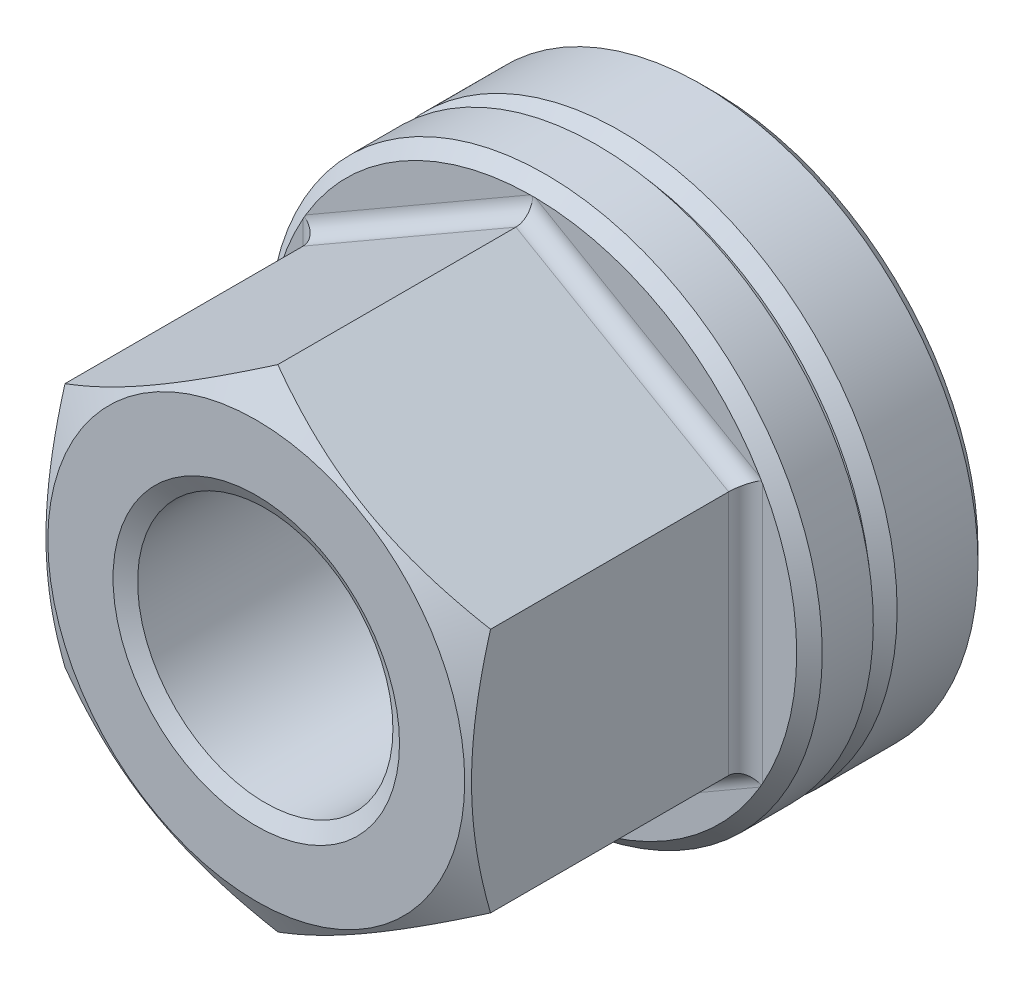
ISO-10303-21;
HEADER;
FILE_DESCRIPTION(('STEP AP214'),'2;1');
FILE_NAME('part.step','',(''),(''),'','','');
FILE_SCHEMA(('AUTOMOTIVE_DESIGN { 1 0 10303 214 1 1 1 1 }'));
ENDSEC;
DATA;
#1=APPLICATION_CONTEXT('core data for automotive mechanical design processes');
#2=APPLICATION_PROTOCOL_DEFINITION('international standard','automotive_design',2000,#1);
#3=PRODUCT_CONTEXT('',#1,'mechanical');
#4=PRODUCT('Part','Part','',(#3));
#5=PRODUCT_RELATED_PRODUCT_CATEGORY('part','',(#4));
#6=PRODUCT_DEFINITION_FORMATION('','',#4);
#7=PRODUCT_DEFINITION_CONTEXT('part definition',#1,'design');
#8=PRODUCT_DEFINITION('design','',#6,#7);
#9=PRODUCT_DEFINITION_SHAPE('','',#8);
#10=(LENGTH_UNIT() NAMED_UNIT(*) SI_UNIT(.MILLI.,.METRE.));
#11=(NAMED_UNIT(*) PLANE_ANGLE_UNIT() SI_UNIT($,.RADIAN.));
#12=(NAMED_UNIT(*) SI_UNIT($,.STERADIAN.) SOLID_ANGLE_UNIT());
#13=UNCERTAINTY_MEASURE_WITH_UNIT(LENGTH_MEASURE(1.E-05),#10,'distance_accuracy_value','');
#14=(GEOMETRIC_REPRESENTATION_CONTEXT(3) GLOBAL_UNCERTAINTY_ASSIGNED_CONTEXT((#13)) GLOBAL_UNIT_ASSIGNED_CONTEXT((#10,
#11,#12)) REPRESENTATION_CONTEXT('',''));
#15=CARTESIAN_POINT('',(0.,0.,0.));
#16=DIRECTION('',(0.,0.,1.));
#17=DIRECTION('',(1.,0.,0.));
#18=AXIS2_PLACEMENT_3D('',#15,#16,#17);
#19=CARTESIAN_POINT('',(0.,0.,2.5));
#20=DIRECTION('',(0.,0.,1.));
#21=DIRECTION('',(1.,0.,0.));
#22=AXIS2_PLACEMENT_3D('',#19,#20,#21);
#23=PLANE('',#22);
#24=CARTESIAN_POINT('',(0.,0.,2.5));
#25=DIRECTION('',(0.,0.,1.));
#26=DIRECTION('',(1.,0.,0.));
#27=AXIS2_PLACEMENT_3D('',#24,#25,#26);
#28=CIRCLE('',#27,6.2);
#29=CARTESIAN_POINT('',(6.2,0.,2.5));
#30=VERTEX_POINT('',#29);
#31=EDGE_CURVE('E419',#30,#30,#28,.T.);
#32=ORIENTED_EDGE('',*,*,#31,.T.);
#33=EDGE_LOOP('',(#32));
#34=FACE_BOUND('',#33,.T.);
#35=CARTESIAN_POINT('',(0.,0.,2.5));
#36=DIRECTION('',(0.,0.,1.));
#37=DIRECTION('',(1.,0.,0.));
#38=AXIS2_PLACEMENT_3D('',#35,#36,#37);
#39=CIRCLE('',#38,5.92818905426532);
#40=CARTESIAN_POINT('',(0.,5.92818905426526,2.5));
#41=VERTEX_POINT('',#40);
#42=EDGE_CURVE('E9',#41,#41,#39,.F.);
#43=ORIENTED_EDGE('',*,*,#42,.T.);
#44=EDGE_LOOP('',(#43));
#45=FACE_BOUND('',#44,.T.);
#46=ADVANCED_FACE('F14',(#34,#45),#23,.T.);
#47=CARTESIAN_POINT('',(0.,0.,20.0362481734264));
#48=DIRECTION('',(0.,0.,-1.));
#49=DIRECTION('',(-1.,0.,0.));
#50=AXIS2_PLACEMENT_3D('',#47,#48,#49);
#51=CYLINDRICAL_SURFACE('',#50,3.8);
#52=CARTESIAN_POINT('',(0.,0.,1.69926548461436));
#53=DIRECTION('',(0.,0.,1.));
#54=DIRECTION('',(1.,0.,0.));
#55=AXIS2_PLACEMENT_3D('',#52,#53,#54);
#56=CIRCLE('',#55,3.8);
#57=CARTESIAN_POINT('',(3.8,0.,1.69926548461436));
#58=VERTEX_POINT('',#57);
#59=EDGE_CURVE('E440',#58,#58,#56,.T.);
#60=ORIENTED_EDGE('',*,*,#59,.F.);
#61=EDGE_LOOP('',(#60));
#62=FACE_BOUND('',#61,.T.);
#63=CARTESIAN_POINT('',(0.,0.,1.76815946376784));
#64=DIRECTION('',(0.,0.,1.));
#65=DIRECTION('',(1.,0.,0.));
#66=AXIS2_PLACEMENT_3D('',#63,#64,#65);
#67=CIRCLE('',#66,3.8);
#68=CARTESIAN_POINT('',(0.,3.79999999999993,1.76815946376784));
#69=VERTEX_POINT('',#68);
#70=EDGE_CURVE('E23',#69,#69,#67,.F.);
#71=ORIENTED_EDGE('',*,*,#70,.F.);
#72=EDGE_LOOP('',(#71));
#73=FACE_BOUND('',#72,.T.);
#74=ADVANCED_FACE('F446',(#62,#73),#51,.F.);
#75=CARTESIAN_POINT('',(0.,0.,1.5900744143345));
#76=DIRECTION('',(0.,0.,1.));
#77=DIRECTION('',(1.,0.,0.));
#78=AXIS2_PLACEMENT_3D('',#75,#76,#77);
#79=CONICAL_SURFACE('',#78,3.5,1.22173047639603);
#80=CARTESIAN_POINT('',(0.,0.,1.5900744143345));
#81=DIRECTION('',(0.,0.,1.));
#82=DIRECTION('',(1.,0.,0.));
#83=AXIS2_PLACEMENT_3D('',#80,#81,#82);
#84=CIRCLE('',#83,3.5);
#85=CARTESIAN_POINT('',(3.5,0.,1.5900744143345));
#86=VERTEX_POINT('',#85);
#87=EDGE_CURVE('E437',#86,#86,#84,.T.);
#88=ORIENTED_EDGE('',*,*,#87,.F.);
#89=EDGE_LOOP('',(#88));
#90=FACE_BOUND('',#89,.T.);
#91=ORIENTED_EDGE('',*,*,#59,.T.);
#92=EDGE_LOOP('',(#91));
#93=FACE_BOUND('',#92,.T.);
#94=ADVANCED_FACE('F444',(#90,#93),#79,.F.);
#95=CARTESIAN_POINT('',(0.,0.,0.));
#96=DIRECTION('',(0.,0.,1.));
#97=DIRECTION('',(1.,0.,0.));
#98=AXIS2_PLACEMENT_3D('',#95,#96,#97);
#99=PLANE('',#98);
#100=CARTESIAN_POINT('',(0.,0.,0.));
#101=DIRECTION('',(0.,0.,1.));
#102=DIRECTION('',(1.,0.,0.));
#103=AXIS2_PLACEMENT_3D('',#100,#101,#102);
#104=CIRCLE('',#103,3.8);
#105=CARTESIAN_POINT('',(3.8,0.,0.));
#106=VERTEX_POINT('',#105);
#107=EDGE_CURVE('E431',#106,#106,#104,.T.);
#108=ORIENTED_EDGE('',*,*,#107,.T.);
#109=EDGE_LOOP('',(#108));
#110=FACE_BOUND('',#109,.T.);
#111=CARTESIAN_POINT('',(0.,0.,0.));
#112=DIRECTION('',(0.,0.,1.));
#113=DIRECTION('',(1.,0.,0.));
#114=AXIS2_PLACEMENT_3D('',#111,#112,#113);
#115=CIRCLE('',#114,6.2);
#116=CARTESIAN_POINT('',(6.2,0.,0.));
#117=VERTEX_POINT('',#116);
#118=EDGE_CURVE('E434',#117,#117,#115,.F.);
#119=ORIENTED_EDGE('',*,*,#118,.T.);
#120=EDGE_LOOP('',(#119));
#121=FACE_BOUND('',#120,.T.);
#122=ADVANCED_FACE('F456',(#110,#121),#99,.F.);
#123=CARTESIAN_POINT('',(0.,0.,2.5));
#124=DIRECTION('',(0.,0.,-1.));
#125=DIRECTION('',(-1.,0.,0.));
#126=AXIS2_PLACEMENT_3D('',#123,#124,#125);
#127=CYLINDRICAL_SURFACE('',#126,6.5);
#128=CARTESIAN_POINT('',(0.,0.,0.3));
#129=DIRECTION('',(0.,0.,1.));
#130=DIRECTION('',(1.,0.,0.));
#131=AXIS2_PLACEMENT_3D('',#128,#129,#130);
#132=CIRCLE('',#131,6.5);
#133=CARTESIAN_POINT('',(6.5,0.,0.3));
#134=VERTEX_POINT('',#133);
#135=EDGE_CURVE('E422',#134,#134,#132,.T.);
#136=ORIENTED_EDGE('',*,*,#135,.T.);
#137=EDGE_LOOP('',(#136));
#138=FACE_BOUND('',#137,.T.);
#139=CARTESIAN_POINT('',(0.,0.,2.2));
#140=DIRECTION('',(0.,0.,1.));
#141=DIRECTION('',(1.,0.,0.));
#142=AXIS2_PLACEMENT_3D('',#139,#140,#141);
#143=CIRCLE('',#142,6.5);
#144=CARTESIAN_POINT('',(6.5,0.,2.2));
#145=VERTEX_POINT('',#144);
#146=EDGE_CURVE('E425',#145,#145,#143,.F.);
#147=ORIENTED_EDGE('',*,*,#146,.T.);
#148=EDGE_LOOP('',(#147));
#149=FACE_BOUND('',#148,.T.);
#150=ADVANCED_FACE('F465',(#138,#149),#127,.T.);
#151=CARTESIAN_POINT('',(0.,0.,3.25586413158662));
#152=DIRECTION('',(0.,0.,1.));
#153=DIRECTION('',(1.,0.,0.));
#154=AXIS2_PLACEMENT_3D('',#151,#152,#153);
#155=CYLINDRICAL_SURFACE('',#154,3.5);
#156=CARTESIAN_POINT('',(0.,0.,0.3));
#157=DIRECTION('',(0.,0.,1.));
#158=DIRECTION('',(1.,0.,0.));
#159=AXIS2_PLACEMENT_3D('',#156,#157,#158);
#160=CIRCLE('',#159,3.5);
#161=CARTESIAN_POINT('',(3.5,0.,0.3));
#162=VERTEX_POINT('',#161);
#163=EDGE_CURVE('E428',#162,#162,#160,.F.);
#164=ORIENTED_EDGE('',*,*,#163,.T.);
#165=EDGE_LOOP('',(#164));
#166=FACE_BOUND('',#165,.T.);
#167=ORIENTED_EDGE('',*,*,#87,.T.);
#168=EDGE_LOOP('',(#167));
#169=FACE_BOUND('',#168,.T.);
#170=ADVANCED_FACE('F462',(#166,#169),#155,.F.);
#171=CARTESIAN_POINT('',(0.,0.,0.));
#172=DIRECTION('',(0.,0.,-1.));
#173=DIRECTION('',(-1.,0.,0.));
#174=AXIS2_PLACEMENT_3D('',#171,#172,#173);
#175=CONICAL_SURFACE('',#174,3.8,0.785398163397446);
#176=ORIENTED_EDGE('',*,*,#163,.F.);
#177=EDGE_LOOP('',(#176));
#178=FACE_BOUND('',#177,.T.);
#179=ORIENTED_EDGE('',*,*,#107,.F.);
#180=EDGE_LOOP('',(#179));
#181=FACE_BOUND('',#180,.T.);
#182=ADVANCED_FACE('F464',(#178,#181),#175,.F.);
#183=CARTESIAN_POINT('',(0.,0.,0.3));
#184=DIRECTION('',(0.,0.,1.));
#185=DIRECTION('',(1.,0.,0.));
#186=AXIS2_PLACEMENT_3D('',#183,#184,#185);
#187=CONICAL_SURFACE('',#186,6.5,0.78539816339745);
#188=ORIENTED_EDGE('',*,*,#118,.F.);
#189=EDGE_LOOP('',(#188));
#190=FACE_BOUND('',#189,.T.);
#191=ORIENTED_EDGE('',*,*,#135,.F.);
#192=EDGE_LOOP('',(#191));
#193=FACE_BOUND('',#192,.T.);
#194=ADVANCED_FACE('F327',(#190,#193),#187,.T.);
#195=CARTESIAN_POINT('',(0.,0.,2.5));
#196=DIRECTION('',(0.,0.,-1.));
#197=DIRECTION('',(-1.,0.,0.));
#198=AXIS2_PLACEMENT_3D('',#195,#196,#197);
#199=CONICAL_SURFACE('',#198,6.2,0.785398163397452);
#200=ORIENTED_EDGE('',*,*,#146,.F.);
#201=EDGE_LOOP('',(#200));
#202=FACE_BOUND('',#201,.T.);
#203=ORIENTED_EDGE('',*,*,#31,.F.);
#204=EDGE_LOOP('',(#203));
#205=FACE_BOUND('',#204,.T.);
#206=ADVANCED_FACE('F319',(#202,#205),#199,.T.);
#207=CARTESIAN_POINT('',(0.,0.,10.7603393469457));
#208=DIRECTION('',(0.,0.,-1.));
#209=DIRECTION('',(-1.,0.,0.));
#210=AXIS2_PLACEMENT_3D('',#207,#208,#209);
#211=CONICAL_SURFACE('',#210,4.89850269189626,1.0471975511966);
#212=CARTESIAN_POINT('',(0.,0.,10.7603393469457));
#213=DIRECTION('',(0.,0.,-1.));
#214=DIRECTION('',(-1.,0.,0.));
#215=AXIS2_PLACEMENT_3D('',#212,#213,#214);
#216=CIRCLE('',#215,4.89850269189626);
#217=CARTESIAN_POINT('',(-4.89850269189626,0.,10.7603393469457));
#218=VERTEX_POINT('',#217);
#219=EDGE_CURVE('E405',#218,#218,#216,.T.);
#220=ORIENTED_EDGE('',*,*,#219,.T.);
#221=EDGE_LOOP('',(#220));
#222=FACE_BOUND('',#221,.T.);
#223=CARTESIAN_POINT('',(-5.0002,2.88663587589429,10.2550911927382));
#224=CARTESIAN_POINT('',(-4.78046540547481,3.01349970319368,10.3283532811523));
#225=CARTESIAN_POINT('',(-4.55885141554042,3.14144859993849,10.3949885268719));
#226=CARTESIAN_POINT('',(-4.11178600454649,3.39956193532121,10.5113008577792));
#227=CARTESIAN_POINT('',(-3.88632664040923,3.52973095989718,10.5609367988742));
#228=CARTESIAN_POINT('',(-3.43816769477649,3.78847564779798,10.6381888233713));
#229=CARTESIAN_POINT('',(-3.21553790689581,3.91701101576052,10.6663194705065));
#230=CARTESIAN_POINT('',(-2.88081009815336,4.11026620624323,10.6915449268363));
#231=CARTESIAN_POINT('',(-2.76915780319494,4.17472868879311,10.6971263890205));
#232=CARTESIAN_POINT('',(-2.5457500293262,4.30371322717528,10.7025376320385));
#233=CARTESIAN_POINT('',(-2.43399455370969,4.36823528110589,10.7023675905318));
#234=CARTESIAN_POINT('',(-2.12781576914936,4.54500768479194,10.6939862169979));
#235=CARTESIAN_POINT('',(-1.93349391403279,4.65719946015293,10.6799100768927));
#236=CARTESIAN_POINT('',(-1.54613989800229,4.88083840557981,10.6352745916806));
#237=CARTESIAN_POINT('',(-1.35310909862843,4.9922847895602,10.6046999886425));
#238=CARTESIAN_POINT('',(-0.964974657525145,5.21637431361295,10.5282713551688));
#239=CARTESIAN_POINT('',(-0.769920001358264,5.32898917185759,10.4820934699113));
#240=CARTESIAN_POINT('',(-0.382719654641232,5.55253939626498,10.377288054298));
#241=CARTESIAN_POINT('',(-0.190569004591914,5.66347762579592,10.3186851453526));
#242=CARTESIAN_POINT('',(0.000200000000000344,5.7736181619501,10.2550911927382));
#243=B_SPLINE_CURVE_WITH_KNOTS('',3,(#223,#224,#225,#226,#227,#228,#229,#230,#231,#232,#233,
#234,#235,#236,#237,#238,#239,#240,#241,#242),.UNSPECIFIED.,.F.,.F.,(4,2,2,2,2,2,2,2,2,4),(0.,
0.79255584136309,1.58701660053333,2.3618153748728,2.74884076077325,3.13585419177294,
3.80962362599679,4.48401723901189,5.17336882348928,5.86136694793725),.UNSPECIFIED.);
#244=CARTESIAN_POINT('',(-5.,2.88675134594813,10.2551578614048));
#245=VERTEX_POINT('',#244);
#246=CARTESIAN_POINT('',(0.,5.77350269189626,10.2551578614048));
#247=VERTEX_POINT('',#246);
#248=EDGE_CURVE('E122',#245,#247,#243,.T.);
#249=ORIENTED_EDGE('',*,*,#248,.F.);
#250=CARTESIAN_POINT('',(-5.,-7.64796514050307,8.31303321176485));
#251=CARTESIAN_POINT('',(-5.,-7.42850000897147,8.41905711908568));
#252=CARTESIAN_POINT('',(-5.,-7.20851506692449,8.5240245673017));
#253=CARTESIAN_POINT('',(-5.,-6.7672244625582,8.73124265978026));
#254=CARTESIAN_POINT('',(-5.,-6.54591857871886,8.83349283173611));
#255=CARTESIAN_POINT('',(-5.,-6.1005054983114,9.03521291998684));
#256=CARTESIAN_POINT('',(-5.,-5.87638951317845,9.13466350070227));
#257=CARTESIAN_POINT('',(-5.,-5.42631248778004,9.32928129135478));
#258=CARTESIAN_POINT('',(-5.,-5.20035154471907,9.42444872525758));
#259=CARTESIAN_POINT('',(-5.,-4.74345800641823,9.61047527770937));
#260=CARTESIAN_POINT('',(-5.,-4.51249834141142,9.70126827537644));
#261=CARTESIAN_POINT('',(-5.,-4.04785175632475,9.87572302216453));
#262=CARTESIAN_POINT('',(-5.,-3.81416453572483,9.95938397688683));
#263=CARTESIAN_POINT('',(-5.,-3.34417457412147,10.1173209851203));
#264=CARTESIAN_POINT('',(-5.,-3.10787863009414,10.1916170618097));
#265=CARTESIAN_POINT('',(-5.,-2.63192544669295,10.3284052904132));
#266=CARTESIAN_POINT('',(-5.,-2.39226929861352,10.3909011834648));
#267=CARTESIAN_POINT('',(-5.,-1.90944023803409,10.5010538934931));
#268=CARTESIAN_POINT('',(-5.,-1.66626630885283,10.5487063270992));
#269=CARTESIAN_POINT('',(-5.,-1.17696169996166,10.6259446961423));
#270=CARTESIAN_POINT('',(-5.,-0.930831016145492,10.6555306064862));
#271=CARTESIAN_POINT('',(-5.,-0.56124820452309,10.6844628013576));
#272=CARTESIAN_POINT('',(-5.,-0.438369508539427,10.6915341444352));
#273=CARTESIAN_POINT('',(-5.,-0.19241728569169,10.7004708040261));
#274=CARTESIAN_POINT('',(-5.,-0.0693437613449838,10.7023361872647));
#275=CARTESIAN_POINT('',(-5.,0.176735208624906,10.7008105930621));
#276=CARTESIAN_POINT('',(-5.,0.29974066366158,10.6974210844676));
#277=CARTESIAN_POINT('',(-5.,0.54550226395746,10.6854713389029));
#278=CARTESIAN_POINT('',(-5.,0.668258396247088,10.676910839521));
#279=CARTESIAN_POINT('',(-5.,0.966054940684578,10.6500491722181));
#280=CARTESIAN_POINT('',(-5.,1.1408640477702,10.6291416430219));
#281=CARTESIAN_POINT('',(-5.,1.48911279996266,10.5780060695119));
#282=CARTESIAN_POINT('',(-5.,1.66255225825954,10.5477767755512));
#283=CARTESIAN_POINT('',(-5.,2.00795437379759,10.4790668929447));
#284=CARTESIAN_POINT('',(-5.,2.17991537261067,10.4405780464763));
#285=CARTESIAN_POINT('',(-5.,2.52207129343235,10.3565224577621));
#286=CARTESIAN_POINT('',(-5.,2.69226632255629,10.3109561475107));
#287=CARTESIAN_POINT('',(-5.,3.03506218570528,10.2126491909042));
#288=CARTESIAN_POINT('',(-5.,3.20762027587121,10.1597605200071));
#289=CARTESIAN_POINT('',(-5.,3.55091234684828,10.0487748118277));
#290=CARTESIAN_POINT('',(-5.,3.72164749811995,9.9906813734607));
#291=CARTESIAN_POINT('',(-5.,4.06060843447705,9.87048465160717));
#292=CARTESIAN_POINT('',(-5.,4.22884293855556,9.80840580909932));
#293=CARTESIAN_POINT('',(-5.,4.56400815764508,9.68061563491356));
#294=CARTESIAN_POINT('',(-5.,4.73093831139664,9.614902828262));
#295=CARTESIAN_POINT('',(-5.,4.89726279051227,9.54773289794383));
#296=B_SPLINE_CURVE_WITH_KNOTS('',3,(#250,#251,#252,#253,#254,#255,#256,#257,#258,#259,#260,
#261,#262,#263,#264,#265,#266,#267,#268,#269,#270,#271,#272,#273,#274,#275,#276,#277,#278,#279,
#280,#281,#282,#283,#284,#285,#286,#287,#288,#289,#290,#291,#292,#293,#294,#295),.UNSPECIFIED.,
.F.,.F.,(4,2,2,2,2,2,2,2,2,2,2,2,2,2,2,2,2,2,2,2,2,2,4),(0.,0.731210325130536,1.46254692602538,
2.19808288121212,2.93358033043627,3.67798361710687,4.42246971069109,5.16533598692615,
5.90796634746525,6.65081580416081,7.39366629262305,7.76281858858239,8.13196615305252,
8.50101055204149,8.87007368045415,9.39794425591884,9.92588562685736,10.4543573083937,
10.9827967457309,11.5241406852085,12.0651131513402,12.6030371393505,13.1411810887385),.UNSPECIFIED.);
#297=CARTESIAN_POINT('',(-5.,-2.88675134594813,10.2551578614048));
#298=VERTEX_POINT('',#297);
#299=EDGE_CURVE('E125',#298,#245,#296,.T.);
#300=ORIENTED_EDGE('',*,*,#299,.F.);
#301=CARTESIAN_POINT('',(0.000199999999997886,-5.7736181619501,10.2550911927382));
#302=CARTESIAN_POINT('',(-0.219534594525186,-5.64675433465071,10.3283532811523));
#303=CARTESIAN_POINT('',(-0.441148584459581,-5.5188054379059,10.3949885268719));
#304=CARTESIAN_POINT('',(-0.888213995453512,-5.26069210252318,10.5113008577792));
#305=CARTESIAN_POINT('',(-1.11367335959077,-5.13052307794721,10.5609367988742));
#306=CARTESIAN_POINT('',(-1.56183230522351,-4.87177839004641,10.6381888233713));
#307=CARTESIAN_POINT('',(-1.78446209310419,-4.74324302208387,10.6663194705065));
#308=CARTESIAN_POINT('',(-2.11918990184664,-4.54998783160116,10.6915449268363));
#309=CARTESIAN_POINT('',(-2.23084219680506,-4.48552534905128,10.6971263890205));
#310=CARTESIAN_POINT('',(-2.4542499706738,-4.35654081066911,10.7025376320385));
#311=CARTESIAN_POINT('',(-2.56600544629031,-4.2920187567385,10.7023675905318));
#312=CARTESIAN_POINT('',(-2.87218423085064,-4.11524635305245,10.6939862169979));
#313=CARTESIAN_POINT('',(-3.06650608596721,-4.00305457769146,10.6799100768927));
#314=CARTESIAN_POINT('',(-3.45386010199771,-3.77941563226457,10.6352745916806));
#315=CARTESIAN_POINT('',(-3.64689090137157,-3.66796924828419,10.6046999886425));
#316=CARTESIAN_POINT('',(-4.03502534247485,-3.44387972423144,10.5282713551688));
#317=CARTESIAN_POINT('',(-4.23007999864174,-3.3312648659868,10.4820934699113));
#318=CARTESIAN_POINT('',(-4.61728034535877,-3.10771464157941,10.377288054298));
#319=CARTESIAN_POINT('',(-4.80943099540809,-2.99677641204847,10.3186851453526));
#320=CARTESIAN_POINT('',(-5.0002,-2.88663587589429,10.2550911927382));
#321=B_SPLINE_CURVE_WITH_KNOTS('',3,(#301,#302,#303,#304,#305,#306,#307,#308,#309,#310,#311,
#312,#313,#314,#315,#316,#317,#318,#319,#320),.UNSPECIFIED.,.F.,.F.,(4,2,2,2,2,2,2,2,2,4),(0.,
0.792555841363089,1.58701660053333,2.3618153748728,2.74884076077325,3.13585419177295,
3.80962362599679,4.48401723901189,5.17336882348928,5.86136694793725),.UNSPECIFIED.);
#322=CARTESIAN_POINT('',(0.,-5.77350269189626,10.2551578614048));
#323=VERTEX_POINT('',#322);
#324=EDGE_CURVE('E141',#323,#298,#321,.T.);
#325=ORIENTED_EDGE('',*,*,#324,.F.);
#326=CARTESIAN_POINT('',(5.0002,-2.88663587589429,10.2550911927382));
#327=CARTESIAN_POINT('',(4.78046540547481,-3.01349970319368,10.3283532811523));
#328=CARTESIAN_POINT('',(4.55885141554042,-3.14144859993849,10.3949885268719));
#329=CARTESIAN_POINT('',(4.11178600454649,-3.39956193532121,10.5113008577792));
#330=CARTESIAN_POINT('',(3.88632664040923,-3.52973095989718,10.5609367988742));
#331=CARTESIAN_POINT('',(3.43816769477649,-3.78847564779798,10.6381888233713));
#332=CARTESIAN_POINT('',(3.21553790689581,-3.91701101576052,10.6663194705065));
#333=CARTESIAN_POINT('',(2.88081009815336,-4.11026620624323,10.6915449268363));
#334=CARTESIAN_POINT('',(2.76915780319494,-4.17472868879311,10.6971263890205));
#335=CARTESIAN_POINT('',(2.5457500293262,-4.30371322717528,10.7025376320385));
#336=CARTESIAN_POINT('',(2.43399455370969,-4.36823528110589,10.7023675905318));
#337=CARTESIAN_POINT('',(2.12781576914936,-4.54500768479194,10.6939862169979));
#338=CARTESIAN_POINT('',(1.93349391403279,-4.65719946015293,10.6799100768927));
#339=CARTESIAN_POINT('',(1.54613989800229,-4.88083840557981,10.6352745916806));
#340=CARTESIAN_POINT('',(1.35310909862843,-4.9922847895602,10.6046999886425));
#341=CARTESIAN_POINT('',(0.964974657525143,-5.21637431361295,10.5282713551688));
#342=CARTESIAN_POINT('',(0.769920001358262,-5.32898917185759,10.4820934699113));
#343=CARTESIAN_POINT('',(0.382719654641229,-5.55253939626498,10.377288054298));
#344=CARTESIAN_POINT('',(0.190569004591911,-5.66347762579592,10.3186851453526));
#345=CARTESIAN_POINT('',(-0.00020000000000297,-5.7736181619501,10.2550911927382));
#346=B_SPLINE_CURVE_WITH_KNOTS('',3,(#326,#327,#328,#329,#330,#331,#332,#333,#334,#335,#336,
#337,#338,#339,#340,#341,#342,#343,#344,#345),.UNSPECIFIED.,.F.,.F.,(4,2,2,2,2,2,2,2,2,4),(0.,
0.792555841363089,1.58701660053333,2.3618153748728,2.74884076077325,3.13585419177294,
3.80962362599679,4.48401723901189,5.17336882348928,5.86136694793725),.UNSPECIFIED.);
#347=CARTESIAN_POINT('',(5.,-2.88675134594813,10.2551578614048));
#348=VERTEX_POINT('',#347);
#349=EDGE_CURVE('E351',#348,#323,#346,.T.);
#350=ORIENTED_EDGE('',*,*,#349,.F.);
#351=CARTESIAN_POINT('',(5.,-7.64796514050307,8.31303321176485));
#352=CARTESIAN_POINT('',(5.,-7.42850000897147,8.41905711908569));
#353=CARTESIAN_POINT('',(5.,-7.20851506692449,8.5240245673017));
#354=CARTESIAN_POINT('',(5.,-6.7672244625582,8.73124265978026));
#355=CARTESIAN_POINT('',(5.,-6.54591857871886,8.83349283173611));
#356=CARTESIAN_POINT('',(5.,-6.1005054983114,9.03521291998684));
#357=CARTESIAN_POINT('',(5.,-5.87638951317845,9.13466350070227));
#358=CARTESIAN_POINT('',(5.,-5.42631248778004,9.32928129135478));
#359=CARTESIAN_POINT('',(5.,-5.20035154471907,9.42444872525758));
#360=CARTESIAN_POINT('',(5.,-4.74345800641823,9.61047527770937));
#361=CARTESIAN_POINT('',(5.,-4.51249834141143,9.70126827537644));
#362=CARTESIAN_POINT('',(5.,-4.04785175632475,9.87572302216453));
#363=CARTESIAN_POINT('',(5.,-3.81416453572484,9.95938397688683));
#364=CARTESIAN_POINT('',(5.,-3.34417457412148,10.1173209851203));
#365=CARTESIAN_POINT('',(5.,-3.10787863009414,10.1916170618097));
#366=CARTESIAN_POINT('',(5.,-2.63192544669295,10.3284052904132));
#367=CARTESIAN_POINT('',(5.,-2.39226929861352,10.3909011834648));
#368=CARTESIAN_POINT('',(5.,-1.90944023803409,10.5010538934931));
#369=CARTESIAN_POINT('',(5.,-1.66626630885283,10.5487063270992));
#370=CARTESIAN_POINT('',(5.,-1.17696169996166,10.6259446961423));
#371=CARTESIAN_POINT('',(5.,-0.930831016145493,10.6555306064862));
#372=CARTESIAN_POINT('',(5.,-0.561248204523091,10.6844628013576));
#373=CARTESIAN_POINT('',(5.,-0.438369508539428,10.6915341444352));
#374=CARTESIAN_POINT('',(5.,-0.192417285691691,10.7004708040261));
#375=CARTESIAN_POINT('',(5.,-0.0693437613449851,10.7023361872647));
#376=CARTESIAN_POINT('',(5.,0.176735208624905,10.7008105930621));
#377=CARTESIAN_POINT('',(5.,0.299740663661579,10.6974210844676));
#378=CARTESIAN_POINT('',(5.,0.545502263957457,10.6854713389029));
#379=CARTESIAN_POINT('',(5.,0.668258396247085,10.676910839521));
#380=CARTESIAN_POINT('',(5.,0.966054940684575,10.6500491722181));
#381=CARTESIAN_POINT('',(5.,1.1408640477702,10.6291416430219));
#382=CARTESIAN_POINT('',(5.,1.48911279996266,10.5780060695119));
#383=CARTESIAN_POINT('',(5.,1.66255225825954,10.5477767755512));
#384=CARTESIAN_POINT('',(5.,2.00795437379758,10.4790668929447));
#385=CARTESIAN_POINT('',(5.,2.17991537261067,10.4405780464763));
#386=CARTESIAN_POINT('',(5.,2.52207129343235,10.3565224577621));
#387=CARTESIAN_POINT('',(5.,2.69226632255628,10.3109561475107));
#388=CARTESIAN_POINT('',(5.,3.03506218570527,10.2126491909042));
#389=CARTESIAN_POINT('',(5.,3.2076202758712,10.1597605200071));
#390=CARTESIAN_POINT('',(5.,3.55091234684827,10.0487748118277));
#391=CARTESIAN_POINT('',(5.,3.72164749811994,9.9906813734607));
#392=CARTESIAN_POINT('',(5.,4.06060843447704,9.87048465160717));
#393=CARTESIAN_POINT('',(5.,4.22884293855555,9.80840580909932));
#394=CARTESIAN_POINT('',(5.,4.56400815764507,9.68061563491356));
#395=CARTESIAN_POINT('',(5.,4.73093831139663,9.614902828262));
#396=CARTESIAN_POINT('',(5.,4.89726279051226,9.54773289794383));
#397=B_SPLINE_CURVE_WITH_KNOTS('',3,(#351,#352,#353,#354,#355,#356,#357,#358,#359,#360,#361,
#362,#363,#364,#365,#366,#367,#368,#369,#370,#371,#372,#373,#374,#375,#376,#377,#378,#379,#380,
#381,#382,#383,#384,#385,#386,#387,#388,#389,#390,#391,#392,#393,#394,#395,#396),.UNSPECIFIED.,
.F.,.F.,(4,2,2,2,2,2,2,2,2,2,2,2,2,2,2,2,2,2,2,2,2,2,4),(0.,0.731210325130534,1.46254692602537,
2.19808288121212,2.93358033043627,3.67798361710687,4.42246971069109,5.16533598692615,
5.90796634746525,6.65081580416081,7.39366629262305,7.76281858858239,8.13196615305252,
8.50101055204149,8.87007368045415,9.39794425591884,9.92588562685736,10.4543573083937,
10.9827967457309,11.5241406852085,12.0651131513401,12.6030371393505,13.1411810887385),.UNSPECIFIED.);
#398=CARTESIAN_POINT('',(5.,2.88675134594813,10.2551578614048));
#399=VERTEX_POINT('',#398);
#400=EDGE_CURVE('E341',#399,#348,#397,.F.);
#401=ORIENTED_EDGE('',*,*,#400,.F.);
#402=CARTESIAN_POINT('',(-0.000199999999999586,5.7736181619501,10.2550911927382));
#403=CARTESIAN_POINT('',(0.219534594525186,5.64675433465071,10.3283532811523));
#404=CARTESIAN_POINT('',(0.441148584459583,5.5188054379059,10.3949885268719));
#405=CARTESIAN_POINT('',(0.888213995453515,5.26069210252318,10.5113008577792));
#406=CARTESIAN_POINT('',(1.11367335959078,5.13052307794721,10.5609367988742));
#407=CARTESIAN_POINT('',(1.56183230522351,4.87177839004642,10.6381888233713));
#408=CARTESIAN_POINT('',(1.78446209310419,4.74324302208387,10.6663194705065));
#409=CARTESIAN_POINT('',(2.11918990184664,4.54998783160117,10.6915449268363));
#410=CARTESIAN_POINT('',(2.23084219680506,4.48552534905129,10.6971263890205));
#411=CARTESIAN_POINT('',(2.4542499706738,4.35654081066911,10.7025376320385));
#412=CARTESIAN_POINT('',(2.56600544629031,4.2920187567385,10.7023675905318));
#413=CARTESIAN_POINT('',(2.87218423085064,4.11524635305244,10.6939862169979));
#414=CARTESIAN_POINT('',(3.06650608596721,4.00305457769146,10.6799100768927));
#415=CARTESIAN_POINT('',(3.45386010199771,3.77941563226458,10.6352745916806));
#416=CARTESIAN_POINT('',(3.64689090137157,3.66796924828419,10.6046999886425));
#417=CARTESIAN_POINT('',(4.03502534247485,3.44387972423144,10.5282713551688));
#418=CARTESIAN_POINT('',(4.23007999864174,3.33126486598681,10.4820934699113));
#419=CARTESIAN_POINT('',(4.61728034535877,3.10771464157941,10.377288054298));
#420=CARTESIAN_POINT('',(4.80943099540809,2.99677641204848,10.3186851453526));
#421=CARTESIAN_POINT('',(5.0002,2.88663587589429,10.2550911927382));
#422=B_SPLINE_CURVE_WITH_KNOTS('',3,(#402,#403,#404,#405,#406,#407,#408,#409,#410,#411,#412,
#413,#414,#415,#416,#417,#418,#419,#420,#421),.UNSPECIFIED.,.F.,.F.,(4,2,2,2,2,2,2,2,2,4),(0.,
0.79255584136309,1.58701660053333,2.3618153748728,2.74884076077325,3.13585419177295,
3.80962362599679,4.48401723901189,5.17336882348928,5.86136694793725),.UNSPECIFIED.);
#423=EDGE_CURVE('E128',#247,#399,#422,.T.);
#424=ORIENTED_EDGE('',*,*,#423,.F.);
#425=EDGE_LOOP('',(#249,#300,#325,#350,#401,#424));
#426=FACE_BOUND('',#425,.T.);
#427=ADVANCED_FACE('F124',(#222,#426),#211,.T.);
#428=CARTESIAN_POINT('',(0.,5.77350269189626,10.7603393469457));
#429=DIRECTION('',(0.5,-0.866025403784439,0.));
#430=DIRECTION('',(0.866025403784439,0.5,0.));
#431=AXIS2_PLACEMENT_3D('',#428,#429,#430);
#432=PLANE('',#431);
#433=DIRECTION('',(0.,0.,-1.));
#434=VECTOR('',#433,1.);
#435=CARTESIAN_POINT('',(0.,5.77350269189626,10.7603393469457));
#436=LINE('',#435,#434);
#437=CARTESIAN_POINT('',(0.,5.77350269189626,4.6603393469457));
#438=VERTEX_POINT('',#437);
#439=EDGE_CURVE('E147',#247,#438,#436,.T.);
#440=ORIENTED_EDGE('',*,*,#439,.T.);
#441=DIRECTION('',(-0.866025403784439,-0.5,0.));
#442=VECTOR('',#441,1.);
#443=CARTESIAN_POINT('',(0.,5.77350269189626,4.6603393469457));
#444=LINE('',#443,#442);
#445=CARTESIAN_POINT('',(-5.,2.88675134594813,4.6603393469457));
#446=VERTEX_POINT('',#445);
#447=EDGE_CURVE('E146',#438,#446,#444,.T.);
#448=ORIENTED_EDGE('',*,*,#447,.T.);
#449=DIRECTION('',(0.,0.,-1.));
#450=VECTOR('',#449,1.);
#451=CARTESIAN_POINT('',(-5.,2.88675134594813,10.7603393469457));
#452=LINE('',#451,#450);
#453=EDGE_CURVE('E138',#245,#446,#452,.T.);
#454=ORIENTED_EDGE('',*,*,#453,.F.);
#455=ORIENTED_EDGE('',*,*,#248,.T.);
#456=EDGE_LOOP('',(#440,#448,#454,#455));
#457=FACE_BOUND('',#456,.T.);
#458=ADVANCED_FACE('F144',(#457),#432,.F.);
#459=CARTESIAN_POINT('',(-5.,2.88675134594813,10.7603393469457));
#460=DIRECTION('',(1.,0.,0.));
#461=DIRECTION('',(0.,0.,-1.));
#462=AXIS2_PLACEMENT_3D('',#459,#460,#461);
#463=PLANE('',#462);
#464=ORIENTED_EDGE('',*,*,#453,.T.);
#465=DIRECTION('',(0.,-1.,0.));
#466=VECTOR('',#465,1.);
#467=CARTESIAN_POINT('',(-5.,2.88675134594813,4.6603393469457));
#468=LINE('',#467,#466);
#469=CARTESIAN_POINT('',(-5.,-2.88675134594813,4.6603393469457));
#470=VERTEX_POINT('',#469);
#471=EDGE_CURVE('E182',#446,#470,#468,.T.);
#472=ORIENTED_EDGE('',*,*,#471,.T.);
#473=DIRECTION('',(0.,0.,-1.));
#474=VECTOR('',#473,1.);
#475=CARTESIAN_POINT('',(-5.,-2.88675134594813,10.7603393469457));
#476=LINE('',#475,#474);
#477=EDGE_CURVE('E140',#298,#470,#476,.T.);
#478=ORIENTED_EDGE('',*,*,#477,.F.);
#479=ORIENTED_EDGE('',*,*,#299,.T.);
#480=EDGE_LOOP('',(#464,#472,#478,#479));
#481=FACE_BOUND('',#480,.T.);
#482=ADVANCED_FACE('F137',(#481),#463,.F.);
#483=CARTESIAN_POINT('',(-5.,-2.88675134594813,10.7603393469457));
#484=DIRECTION('',(0.5,0.866025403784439,0.));
#485=DIRECTION('',(-0.866025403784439,0.5,0.));
#486=AXIS2_PLACEMENT_3D('',#483,#484,#485);
#487=PLANE('',#486);
#488=ORIENTED_EDGE('',*,*,#477,.T.);
#489=DIRECTION('',(0.866025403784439,-0.5,0.));
#490=VECTOR('',#489,1.);
#491=CARTESIAN_POINT('',(-5.,-2.88675134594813,4.6603393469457));
#492=LINE('',#491,#490);
#493=CARTESIAN_POINT('',(0.,-5.77350269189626,4.6603393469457));
#494=VERTEX_POINT('',#493);
#495=EDGE_CURVE('E184',#470,#494,#492,.T.);
#496=ORIENTED_EDGE('',*,*,#495,.T.);
#497=DIRECTION('',(0.,0.,-1.));
#498=VECTOR('',#497,1.);
#499=CARTESIAN_POINT('',(0.,-5.77350269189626,10.7603393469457));
#500=LINE('',#499,#498);
#501=EDGE_CURVE('E151',#323,#494,#500,.T.);
#502=ORIENTED_EDGE('',*,*,#501,.F.);
#503=ORIENTED_EDGE('',*,*,#324,.T.);
#504=EDGE_LOOP('',(#488,#496,#502,#503));
#505=FACE_BOUND('',#504,.T.);
#506=ADVANCED_FACE('F515',(#505),#487,.F.);
#507=CARTESIAN_POINT('',(0.,-5.77350269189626,10.7603393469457));
#508=DIRECTION('',(-0.5,0.866025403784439,0.));
#509=DIRECTION('',(-0.866025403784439,-0.5,0.));
#510=AXIS2_PLACEMENT_3D('',#507,#508,#509);
#511=PLANE('',#510);
#512=ORIENTED_EDGE('',*,*,#501,.T.);
#513=DIRECTION('',(0.866025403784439,0.5,0.));
#514=VECTOR('',#513,1.);
#515=CARTESIAN_POINT('',(0.,-5.77350269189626,4.6603393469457));
#516=LINE('',#515,#514);
#517=CARTESIAN_POINT('',(5.,-2.88675134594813,4.6603393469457));
#518=VERTEX_POINT('',#517);
#519=EDGE_CURVE('E186',#494,#518,#516,.T.);
#520=ORIENTED_EDGE('',*,*,#519,.T.);
#521=DIRECTION('',(0.,0.,-1.));
#522=VECTOR('',#521,1.);
#523=CARTESIAN_POINT('',(5.,-2.88675134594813,10.7603393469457));
#524=LINE('',#523,#522);
#525=EDGE_CURVE('E533',#348,#518,#524,.T.);
#526=ORIENTED_EDGE('',*,*,#525,.F.);
#527=ORIENTED_EDGE('',*,*,#349,.T.);
#528=EDGE_LOOP('',(#512,#520,#526,#527));
#529=FACE_BOUND('',#528,.T.);
#530=ADVANCED_FACE('F531',(#529),#511,.F.);
#531=CARTESIAN_POINT('',(5.,-2.88675134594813,10.7603393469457));
#532=DIRECTION('',(-1.,0.,0.));
#533=DIRECTION('',(0.,-1.,0.));
#534=AXIS2_PLACEMENT_3D('',#531,#532,#533);
#535=PLANE('',#534);
#536=ORIENTED_EDGE('',*,*,#525,.T.);
#537=DIRECTION('',(0.,1.,0.));
#538=VECTOR('',#537,1.);
#539=CARTESIAN_POINT('',(5.,-2.88675134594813,4.6603393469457));
#540=LINE('',#539,#538);
#541=CARTESIAN_POINT('',(5.,2.88675134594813,4.6603393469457));
#542=VERTEX_POINT('',#541);
#543=EDGE_CURVE('E188',#518,#542,#540,.T.);
#544=ORIENTED_EDGE('',*,*,#543,.T.);
#545=DIRECTION('',(0.,0.,-1.));
#546=VECTOR('',#545,1.);
#547=CARTESIAN_POINT('',(5.,2.88675134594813,10.7603393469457));
#548=LINE('',#547,#546);
#549=EDGE_CURVE('E538',#399,#542,#548,.T.);
#550=ORIENTED_EDGE('',*,*,#549,.F.);
#551=ORIENTED_EDGE('',*,*,#400,.T.);
#552=EDGE_LOOP('',(#536,#544,#550,#551));
#553=FACE_BOUND('',#552,.T.);
#554=ADVANCED_FACE('F385',(#553),#535,.F.);
#555=CARTESIAN_POINT('',(5.,2.88675134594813,10.7603393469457));
#556=DIRECTION('',(-0.5,-0.866025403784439,0.));
#557=DIRECTION('',(0.866025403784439,-0.5,0.));
#558=AXIS2_PLACEMENT_3D('',#555,#556,#557);
#559=PLANE('',#558);
#560=ORIENTED_EDGE('',*,*,#549,.T.);
#561=DIRECTION('',(-0.866025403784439,0.5,0.));
#562=VECTOR('',#561,1.);
#563=CARTESIAN_POINT('',(5.,2.88675134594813,4.6603393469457));
#564=LINE('',#563,#562);
#565=EDGE_CURVE('E190',#542,#438,#564,.T.);
#566=ORIENTED_EDGE('',*,*,#565,.T.);
#567=ORIENTED_EDGE('',*,*,#439,.F.);
#568=ORIENTED_EDGE('',*,*,#423,.T.);
#569=EDGE_LOOP('',(#560,#566,#567,#568));
#570=FACE_BOUND('',#569,.T.);
#571=ADVANCED_FACE('F381',(#570),#559,.F.);
#572=CARTESIAN_POINT('',(0.,0.,4.2603393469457));
#573=DIRECTION('',(0.,0.,1.));
#574=DIRECTION('',(1.,0.,0.));
#575=AXIS2_PLACEMENT_3D('',#572,#573,#574);
#576=PLANE('',#575);
#577=CARTESIAN_POINT('',(0.,0.,4.2603393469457));
#578=DIRECTION('',(0.,0.,1.));
#579=DIRECTION('',(1.,0.,0.));
#580=AXIS2_PLACEMENT_3D('',#577,#578,#579);
#581=CIRCLE('',#580,6.2);
#582=CARTESIAN_POINT('',(-0.0618188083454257,6.19969180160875,4.2603393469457));
#583=VERTEX_POINT('',#582);
#584=CARTESIAN_POINT('',(-5.33818119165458,3.15338255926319,4.2603393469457));
#585=VERTEX_POINT('',#584);
#586=EDGE_CURVE('E548',#583,#585,#581,.T.);
#587=ORIENTED_EDGE('',*,*,#586,.T.);
#588=DIRECTION('',(-0.866025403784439,-0.5,0.));
#589=VECTOR('',#588,1.);
#590=CARTESIAN_POINT('',(-2.7,4.67653718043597,4.2603393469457));
#591=LINE('',#590,#589);
#592=EDGE_CURVE('E179',#585,#583,#591,.F.);
#593=ORIENTED_EDGE('',*,*,#592,.T.);
#594=EDGE_LOOP('',(#587,#593));
#595=FACE_BOUND('',#594,.T.);
#596=ADVANCED_FACE('F384',(#595),#576,.T.);
#597=CARTESIAN_POINT('',(-0.2,6.11991285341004,4.6603393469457));
#598=DIRECTION('',(-0.866025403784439,-0.5,0.));
#599=DIRECTION('',(0.5,-0.866025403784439,0.));
#600=AXIS2_PLACEMENT_3D('',#597,#598,#599);
#601=CYLINDRICAL_SURFACE('',#600,0.4);
#602=CARTESIAN_POINT('',(-0.0618188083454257,6.19969180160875,4.2603393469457));
#603=CARTESIAN_POINT('',(-0.051507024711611,6.19980386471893,4.26033005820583));
#604=CARTESIAN_POINT('',(-0.041199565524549,6.19978051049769,4.2604304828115));
#605=CARTESIAN_POINT('',(-0.0205932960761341,6.19946296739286,4.26085075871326));
#606=CARTESIAN_POINT('',(-0.0102944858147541,6.19916877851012,4.26117061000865));
#607=CARTESIAN_POINT('',(0.,6.1987391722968,4.2616001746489));
#608=B_SPLINE_CURVE_WITH_KNOTS('',3,(#602,#603,#604,#605,#606,#607),.UNSPECIFIED.,.F.,.F.,(4,2,
4),(0.,0.0309239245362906,0.0618478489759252),.UNSPECIFIED.);
#609=CARTESIAN_POINT('',(0.,6.1987391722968,4.2616001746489));
#610=VERTEX_POINT('',#609);
#611=EDGE_CURVE('E200',#583,#610,#608,.T.);
#612=ORIENTED_EDGE('',*,*,#611,.F.);
#613=ORIENTED_EDGE('',*,*,#592,.F.);
#614=CARTESIAN_POINT('',(-5.36826559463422,3.09936958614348,4.26160017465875));
#615=CARTESIAN_POINT('',(-5.36349040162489,3.10849967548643,4.2611706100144));
#616=CARTESIAN_POINT('',(-5.35859577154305,3.11756580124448,4.26085075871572));
#617=CARTESIAN_POINT('',(-5.34856763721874,3.13557012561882,4.26043048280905));
#618=CARTESIAN_POINT('',(-5.34343413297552,3.1445083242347,4.26033005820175));
#619=CARTESIAN_POINT('',(-5.33818119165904,3.15338255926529,4.26033934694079));
#620=B_SPLINE_CURVE_WITH_KNOTS('',3,(#614,#615,#616,#617,#618,#619),.UNSPECIFIED.,.F.,.F.,(4,2,
4),(0.,0.0309239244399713,0.0618478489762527),.UNSPECIFIED.);
#621=CARTESIAN_POINT('',(-5.36826559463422,3.09936958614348,4.26160017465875));
#622=VERTEX_POINT('',#621);
#623=EDGE_CURVE('E192',#622,#585,#620,.T.);
#624=ORIENTED_EDGE('',*,*,#623,.F.);
#625=CARTESIAN_POINT('',(-5.4,3.11769145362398,4.6603393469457));
#626=DIRECTION('',(-0.5,-0.866025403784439,0.));
#627=DIRECTION('',(-0.866025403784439,0.5,0.));
#628=AXIS2_PLACEMENT_3D('',#625,#626,#627);
#629=ELLIPSE('',#628,0.461880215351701,0.4);
#630=EDGE_CURVE('E415',#622,#446,#629,.T.);
#631=ORIENTED_EDGE('',*,*,#630,.T.);
#632=ORIENTED_EDGE('',*,*,#447,.F.);
#633=CARTESIAN_POINT('',(0.,6.23538290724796,4.6603393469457));
#634=DIRECTION('',(-1.,0.,0.));
#635=DIRECTION('',(0.,-1.,0.));
#636=AXIS2_PLACEMENT_3D('',#633,#634,#635);
#637=ELLIPSE('',#636,0.461880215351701,0.4);
#638=EDGE_CURVE('E502',#438,#610,#637,.F.);
#639=ORIENTED_EDGE('',*,*,#638,.T.);
#640=EDGE_LOOP('',(#612,#613,#624,#631,#632,#639));
#641=FACE_BOUND('',#640,.T.);
#642=ADVANCED_FACE('F206',(#641),#601,.F.);
#643=CARTESIAN_POINT('',(-5.4,3.04630924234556,4.2603393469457));
#644=VERTEX_POINT('',#643);
#645=CARTESIAN_POINT('',(-5.4,-3.04630924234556,4.2603393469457));
#646=VERTEX_POINT('',#645);
#647=EDGE_CURVE('E549',#644,#646,#581,.T.);
#648=ORIENTED_EDGE('',*,*,#647,.T.);
#649=DIRECTION('',(0.,-1.,0.));
#650=VECTOR('',#649,1.);
#651=CARTESIAN_POINT('',(-5.4,0.,4.2603393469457));
#652=LINE('',#651,#650);
#653=EDGE_CURVE('E177',#646,#644,#652,.F.);
#654=ORIENTED_EDGE('',*,*,#653,.T.);
#655=EDGE_LOOP('',(#648,#654));
#656=FACE_BOUND('',#655,.T.);
#657=ADVANCED_FACE('F562',(#656),#576,.T.);
#658=CARTESIAN_POINT('',(-5.4,2.88675134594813,4.6603393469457));
#659=DIRECTION('',(0.,-1.,0.));
#660=DIRECTION('',(0.,0.,-1.));
#661=AXIS2_PLACEMENT_3D('',#658,#659,#660);
#662=CYLINDRICAL_SURFACE('',#661,0.4);
#663=CARTESIAN_POINT('',(-5.4,-3.11769145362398,4.6603393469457));
#664=DIRECTION('',(0.5,-0.866025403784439,0.));
#665=DIRECTION('',(-0.866025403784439,-0.5,0.));
#666=AXIS2_PLACEMENT_3D('',#663,#664,#665);
#667=ELLIPSE('',#666,0.461880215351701,0.4);
#668=CARTESIAN_POINT('',(-5.36826559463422,-3.09936958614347,4.26160017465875));
#669=VERTEX_POINT('',#668);
#670=EDGE_CURVE('E499',#669,#470,#667,.T.);
#671=ORIENTED_EDGE('',*,*,#670,.T.);
#672=ORIENTED_EDGE('',*,*,#471,.F.);
#673=ORIENTED_EDGE('',*,*,#630,.F.);
#674=CARTESIAN_POINT('',(-5.4,3.04630924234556,4.2603393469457));
#675=CARTESIAN_POINT('',(-5.39494115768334,3.05529554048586,4.26033005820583));
#676=CARTESIAN_POINT('',(-5.38976720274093,3.06421038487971,4.2604304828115));
#677=CARTESIAN_POINT('',(-5.37918906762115,3.08189716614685,4.26085075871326));
#678=CARTESIAN_POINT('',(-5.37378488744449,3.09066910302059,4.26117061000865));
#679=CARTESIAN_POINT('',(-5.3682655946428,3.09936958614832,4.2616001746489));
#680=B_SPLINE_CURVE_WITH_KNOTS('',3,(#674,#675,#676,#677,#678,#679),.UNSPECIFIED.,.F.,.F.,(4,2,
4),(0.,0.0309239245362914,0.0618478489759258),.UNSPECIFIED.);
#681=EDGE_CURVE('E233',#644,#622,#680,.T.);
#682=ORIENTED_EDGE('',*,*,#681,.F.);
#683=ORIENTED_EDGE('',*,*,#653,.F.);
#684=CARTESIAN_POINT('',(-5.36826559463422,-3.09936958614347,4.26160017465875));
#685=CARTESIAN_POINT('',(-5.37378488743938,-3.09066910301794,4.2611706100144));
#686=CARTESIAN_POINT('',(-5.37918906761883,-3.08189716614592,4.26085075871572));
#687=CARTESIAN_POINT('',(-5.38976720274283,-3.06421038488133,4.26043048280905));
#688=CARTESIAN_POINT('',(-5.39494115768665,-3.05529554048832,4.26033005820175));
#689=CARTESIAN_POINT('',(-5.40000000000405,-3.04630924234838,4.26033934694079));
#690=B_SPLINE_CURVE_WITH_KNOTS('',3,(#684,#685,#686,#687,#688,#689),.UNSPECIFIED.,.F.,.F.,(4,2,
4),(0.,0.0309239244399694,0.0618478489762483),.UNSPECIFIED.);
#691=EDGE_CURVE('E226',#669,#646,#690,.T.);
#692=ORIENTED_EDGE('',*,*,#691,.F.);
#693=EDGE_LOOP('',(#671,#672,#673,#682,#683,#692));
#694=FACE_BOUND('',#693,.T.);
#695=ADVANCED_FACE('F296',(#694),#662,.F.);
#696=CARTESIAN_POINT('',(-5.33818119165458,-3.15338255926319,4.2603393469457));
#697=VERTEX_POINT('',#696);
#698=CARTESIAN_POINT('',(-0.0618188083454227,-6.19969180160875,4.2603393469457));
#699=VERTEX_POINT('',#698);
#700=EDGE_CURVE('E552',#697,#699,#581,.T.);
#701=ORIENTED_EDGE('',*,*,#700,.T.);
#702=DIRECTION('',(0.866025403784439,-0.5,0.));
#703=VECTOR('',#702,1.);
#704=CARTESIAN_POINT('',(-2.7,-4.67653718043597,4.2603393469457));
#705=LINE('',#704,#703);
#706=EDGE_CURVE('E175',#699,#697,#705,.F.);
#707=ORIENTED_EDGE('',*,*,#706,.T.);
#708=EDGE_LOOP('',(#701,#707));
#709=FACE_BOUND('',#708,.T.);
#710=ADVANCED_FACE('F303',(#709),#576,.T.);
#711=CARTESIAN_POINT('',(-5.2,-3.2331615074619,4.6603393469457));
#712=DIRECTION('',(0.866025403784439,-0.5,0.));
#713=DIRECTION('',(0.5,0.866025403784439,0.));
#714=AXIS2_PLACEMENT_3D('',#711,#712,#713);
#715=CYLINDRICAL_SURFACE('',#714,0.4);
#716=CARTESIAN_POINT('',(0.,-6.23538290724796,4.6603393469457));
#717=DIRECTION('',(1.,0.,0.));
#718=DIRECTION('',(0.,-1.,0.));
#719=AXIS2_PLACEMENT_3D('',#716,#717,#718);
#720=ELLIPSE('',#719,0.461880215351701,0.4);
#721=CARTESIAN_POINT('',(0.,-6.19873917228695,4.26160017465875));
#722=VERTEX_POINT('',#721);
#723=EDGE_CURVE('E493',#722,#494,#720,.T.);
#724=ORIENTED_EDGE('',*,*,#723,.T.);
#725=ORIENTED_EDGE('',*,*,#495,.F.);
#726=ORIENTED_EDGE('',*,*,#670,.F.);
#727=CARTESIAN_POINT('',(-5.33818119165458,-3.15338255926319,4.2603393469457));
#728=CARTESIAN_POINT('',(-5.34343413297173,-3.14450832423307,4.26033005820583));
#729=CARTESIAN_POINT('',(-5.34856763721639,-3.13557012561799,4.2604304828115));
#730=CARTESIAN_POINT('',(-5.35859577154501,-3.11756580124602,4.26085075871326));
#731=CARTESIAN_POINT('',(-5.36349040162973,-3.10849967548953,4.26117061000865));
#732=CARTESIAN_POINT('',(-5.3682655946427,-3.09936958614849,4.2616001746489));
#733=B_SPLINE_CURVE_WITH_KNOTS('',3,(#727,#728,#729,#730,#731,#732),.UNSPECIFIED.,.F.,.F.,(4,2,
4),(0.,0.0309239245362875,0.0618478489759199),.UNSPECIFIED.);
#734=EDGE_CURVE('E248',#697,#669,#733,.T.);
#735=ORIENTED_EDGE('',*,*,#734,.F.);
#736=ORIENTED_EDGE('',*,*,#706,.F.);
#737=CARTESIAN_POINT('',(0.,-6.19873917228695,4.26160017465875));
#738=CARTESIAN_POINT('',(-0.0102944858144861,-6.19916877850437,4.2611706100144));
#739=CARTESIAN_POINT('',(-0.0205932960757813,-6.1994629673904,4.26085075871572));
#740=CARTESIAN_POINT('',(-0.0411995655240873,-6.19978051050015,4.26043048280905));
#741=CARTESIAN_POINT('',(-0.0515070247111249,-6.19980386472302,4.26033005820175));
#742=CARTESIAN_POINT('',(-0.0618188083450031,-6.19969180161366,4.26033934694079));
#743=B_SPLINE_CURVE_WITH_KNOTS('',3,(#737,#738,#739,#740,#741,#742),.UNSPECIFIED.,.F.,.F.,(4,2,
4),(0.,0.030923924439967,0.0618478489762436),.UNSPECIFIED.);
#744=EDGE_CURVE('E240',#722,#699,#743,.T.);
#745=ORIENTED_EDGE('',*,*,#744,.F.);
#746=EDGE_LOOP('',(#724,#725,#726,#735,#736,#745));
#747=FACE_BOUND('',#746,.T.);
#748=ADVANCED_FACE('F298',(#747),#715,.F.);
#749=CARTESIAN_POINT('',(0.0618188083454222,-6.19969180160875,4.2603393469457));
#750=VERTEX_POINT('',#749);
#751=CARTESIAN_POINT('',(5.33818119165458,-3.15338255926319,4.2603393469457));
#752=VERTEX_POINT('',#751);
#753=EDGE_CURVE('E157',#750,#752,#581,.T.);
#754=ORIENTED_EDGE('',*,*,#753,.T.);
#755=DIRECTION('',(0.866025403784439,0.5,0.));
#756=VECTOR('',#755,1.);
#757=CARTESIAN_POINT('',(2.7,-4.67653718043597,4.2603393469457));
#758=LINE('',#757,#756);
#759=EDGE_CURVE('E173',#752,#750,#758,.F.);
#760=ORIENTED_EDGE('',*,*,#759,.T.);
#761=EDGE_LOOP('',(#754,#760));
#762=FACE_BOUND('',#761,.T.);
#763=ADVANCED_FACE('F302',(#762),#576,.T.);
#764=CARTESIAN_POINT('',(0.199999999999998,-6.11991285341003,4.6603393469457));
#765=DIRECTION('',(0.866025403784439,0.5,0.));
#766=DIRECTION('',(-0.5,0.866025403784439,0.));
#767=AXIS2_PLACEMENT_3D('',#764,#765,#766);
#768=CYLINDRICAL_SURFACE('',#767,0.4);
#769=ORIENTED_EDGE('',*,*,#759,.F.);
#770=CARTESIAN_POINT('',(5.36826559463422,-3.09936958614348,4.26160017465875));
#771=CARTESIAN_POINT('',(5.36349040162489,-3.10849967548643,4.2611706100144));
#772=CARTESIAN_POINT('',(5.35859577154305,-3.11756580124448,4.26085075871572));
#773=CARTESIAN_POINT('',(5.34856763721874,-3.13557012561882,4.26043048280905));
#774=CARTESIAN_POINT('',(5.34343413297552,-3.1445083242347,4.26033005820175));
#775=CARTESIAN_POINT('',(5.33818119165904,-3.15338255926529,4.26033934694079));
#776=B_SPLINE_CURVE_WITH_KNOTS('',3,(#770,#771,#772,#773,#774,#775),.UNSPECIFIED.,.F.,.F.,(4,2,
4),(0.,0.0309239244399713,0.0618478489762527),.UNSPECIFIED.);
#777=CARTESIAN_POINT('',(5.36826559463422,-3.09936958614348,4.26160017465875));
#778=VERTEX_POINT('',#777);
#779=EDGE_CURVE('E255',#778,#752,#776,.T.);
#780=ORIENTED_EDGE('',*,*,#779,.F.);
#781=CARTESIAN_POINT('',(5.4,-3.11769145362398,4.6603393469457));
#782=DIRECTION('',(0.5,0.866025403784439,0.));
#783=DIRECTION('',(0.866025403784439,-0.5,0.));
#784=AXIS2_PLACEMENT_3D('',#781,#782,#783);
#785=ELLIPSE('',#784,0.461880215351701,0.4);
#786=EDGE_CURVE('E409',#518,#778,#785,.F.);
#787=ORIENTED_EDGE('',*,*,#786,.F.);
#788=ORIENTED_EDGE('',*,*,#519,.F.);
#789=ORIENTED_EDGE('',*,*,#723,.F.);
#790=CARTESIAN_POINT('',(0.0618188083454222,-6.19969180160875,4.2603393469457));
#791=CARTESIAN_POINT('',(0.0515070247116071,-6.19980386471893,4.26033005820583));
#792=CARTESIAN_POINT('',(0.0411995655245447,-6.19978051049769,4.2604304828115));
#793=CARTESIAN_POINT('',(0.0205932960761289,-6.19946296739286,4.26085075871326));
#794=CARTESIAN_POINT('',(0.0102944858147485,-6.19916877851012,4.26117061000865));
#795=CARTESIAN_POINT('',(0.,-6.1987391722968,4.2616001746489));
#796=B_SPLINE_CURVE_WITH_KNOTS('',3,(#790,#791,#792,#793,#794,#795),.UNSPECIFIED.,.F.,.F.,(4,2,
4),(0.,0.0309239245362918,0.0618478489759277),.UNSPECIFIED.);
#797=EDGE_CURVE('E262',#750,#722,#796,.T.);
#798=ORIENTED_EDGE('',*,*,#797,.F.);
#799=EDGE_LOOP('',(#769,#780,#787,#788,#789,#798));
#800=FACE_BOUND('',#799,.T.);
#801=ADVANCED_FACE('F16',(#800),#768,.F.);
#802=CARTESIAN_POINT('',(5.4,-3.04630924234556,4.2603393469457));
#803=VERTEX_POINT('',#802);
#804=CARTESIAN_POINT('',(5.4,3.04630924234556,4.2603393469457));
#805=VERTEX_POINT('',#804);
#806=EDGE_CURVE('E149',#803,#805,#581,.T.);
#807=ORIENTED_EDGE('',*,*,#806,.T.);
#808=DIRECTION('',(0.,1.,0.));
#809=VECTOR('',#808,1.);
#810=CARTESIAN_POINT('',(5.4,0.,4.2603393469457));
#811=LINE('',#810,#809);
#812=EDGE_CURVE('E171',#805,#803,#811,.F.);
#813=ORIENTED_EDGE('',*,*,#812,.T.);
#814=EDGE_LOOP('',(#807,#813));
#815=FACE_BOUND('',#814,.T.);
#816=ADVANCED_FACE('F308',(#815),#576,.T.);
#817=CARTESIAN_POINT('',(5.4,-2.88675134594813,4.6603393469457));
#818=DIRECTION('',(0.,1.,0.));
#819=DIRECTION('',(-1.,0.,0.));
#820=AXIS2_PLACEMENT_3D('',#817,#818,#819);
#821=CYLINDRICAL_SURFACE('',#820,0.4);
#822=ORIENTED_EDGE('',*,*,#812,.F.);
#823=CARTESIAN_POINT('',(5.36826559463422,3.09936958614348,4.26160017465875));
#824=CARTESIAN_POINT('',(5.37378488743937,3.09066910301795,4.2611706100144));
#825=CARTESIAN_POINT('',(5.37918906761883,3.08189716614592,4.26085075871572));
#826=CARTESIAN_POINT('',(5.38976720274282,3.06421038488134,4.26043048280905));
#827=CARTESIAN_POINT('',(5.39494115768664,3.05529554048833,4.26033005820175));
#828=CARTESIAN_POINT('',(5.40000000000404,3.04630924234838,4.26033934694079));
#829=B_SPLINE_CURVE_WITH_KNOTS('',3,(#823,#824,#825,#826,#827,#828),.UNSPECIFIED.,.F.,.F.,(4,2,
4),(0.,0.0309239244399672,0.0618478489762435),.UNSPECIFIED.);
#830=CARTESIAN_POINT('',(5.36826559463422,3.09936958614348,4.26160017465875));
#831=VERTEX_POINT('',#830);
#832=EDGE_CURVE('E269',#831,#805,#829,.T.);
#833=ORIENTED_EDGE('',*,*,#832,.F.);
#834=CARTESIAN_POINT('',(5.4,3.11769145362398,4.6603393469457));
#835=DIRECTION('',(-0.5,0.866025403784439,0.));
#836=DIRECTION('',(0.866025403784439,0.5,0.));
#837=AXIS2_PLACEMENT_3D('',#834,#835,#836);
#838=ELLIPSE('',#837,0.461880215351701,0.4);
#839=EDGE_CURVE('E496',#542,#831,#838,.F.);
#840=ORIENTED_EDGE('',*,*,#839,.F.);
#841=ORIENTED_EDGE('',*,*,#543,.F.);
#842=ORIENTED_EDGE('',*,*,#786,.T.);
#843=CARTESIAN_POINT('',(5.4,-3.04630924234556,4.2603393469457));
#844=CARTESIAN_POINT('',(5.39494115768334,-3.05529554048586,4.26033005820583));
#845=CARTESIAN_POINT('',(5.38976720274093,-3.06421038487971,4.2604304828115));
#846=CARTESIAN_POINT('',(5.37918906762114,-3.08189716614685,4.26085075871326));
#847=CARTESIAN_POINT('',(5.37378488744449,-3.09066910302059,4.26117061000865));
#848=CARTESIAN_POINT('',(5.3682655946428,-3.09936958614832,4.2616001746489));
#849=B_SPLINE_CURVE_WITH_KNOTS('',3,(#843,#844,#845,#846,#847,#848),.UNSPECIFIED.,.F.,.F.,(4,2,
4),(0.,0.0309239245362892,0.0618478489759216),.UNSPECIFIED.);
#850=EDGE_CURVE('E37',#803,#778,#849,.T.);
#851=ORIENTED_EDGE('',*,*,#850,.F.);
#852=EDGE_LOOP('',(#822,#833,#840,#841,#842,#851));
#853=FACE_BOUND('',#852,.T.);
#854=ADVANCED_FACE('F294',(#853),#821,.F.);
#855=CARTESIAN_POINT('',(5.2,3.23316150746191,4.6603393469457));
#856=DIRECTION('',(-0.866025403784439,0.5,0.));
#857=DIRECTION('',(-0.5,-0.866025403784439,0.));
#858=AXIS2_PLACEMENT_3D('',#855,#856,#857);
#859=CYLINDRICAL_SURFACE('',#858,0.4);
#860=DIRECTION('',(-0.866025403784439,0.5,0.));
#861=VECTOR('',#860,1.);
#862=CARTESIAN_POINT('',(2.7,4.67653718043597,4.2603393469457));
#863=LINE('',#862,#861);
#864=CARTESIAN_POINT('',(0.0618188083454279,6.19969180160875,4.2603393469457));
#865=VERTEX_POINT('',#864);
#866=CARTESIAN_POINT('',(5.33818119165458,3.1533825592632,4.2603393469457));
#867=VERTEX_POINT('',#866);
#868=EDGE_CURVE('E169',#865,#867,#863,.F.);
#869=ORIENTED_EDGE('',*,*,#868,.F.);
#870=CARTESIAN_POINT('',(0.,6.19873917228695,4.26160017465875));
#871=CARTESIAN_POINT('',(0.0102944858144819,6.19916877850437,4.2611706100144));
#872=CARTESIAN_POINT('',(0.0205932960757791,6.1994629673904,4.26085075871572));
#873=CARTESIAN_POINT('',(0.0411995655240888,6.19978051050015,4.26043048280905));
#874=CARTESIAN_POINT('',(0.0515070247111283,6.19980386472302,4.26033005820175));
#875=CARTESIAN_POINT('',(0.0618188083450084,6.19969180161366,4.26033934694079));
#876=B_SPLINE_CURVE_WITH_KNOTS('',3,(#870,#871,#872,#873,#874,#875),.UNSPECIFIED.,.F.,.F.,(4,2,
4),(0.,0.0309239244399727,0.0618478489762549),.UNSPECIFIED.);
#877=EDGE_CURVE('E280',#610,#865,#876,.T.);
#878=ORIENTED_EDGE('',*,*,#877,.F.);
#879=ORIENTED_EDGE('',*,*,#638,.F.);
#880=ORIENTED_EDGE('',*,*,#565,.F.);
#881=ORIENTED_EDGE('',*,*,#839,.T.);
#882=CARTESIAN_POINT('',(5.33818119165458,3.1533825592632,4.2603393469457));
#883=CARTESIAN_POINT('',(5.34343413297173,3.14450832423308,4.26033005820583));
#884=CARTESIAN_POINT('',(5.34856763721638,3.13557012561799,4.2604304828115));
#885=CARTESIAN_POINT('',(5.35859577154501,3.11756580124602,4.26085075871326));
#886=CARTESIAN_POINT('',(5.36349040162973,3.10849967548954,4.26117061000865));
#887=CARTESIAN_POINT('',(5.3682655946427,3.09936958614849,4.2616001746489));
#888=B_SPLINE_CURVE_WITH_KNOTS('',3,(#882,#883,#884,#885,#886,#887),.UNSPECIFIED.,.F.,.F.,(4,2,
4),(0.,0.0309239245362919,0.0618478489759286),.UNSPECIFIED.);
#889=EDGE_CURVE('E30',#867,#831,#888,.T.);
#890=ORIENTED_EDGE('',*,*,#889,.F.);
#891=EDGE_LOOP('',(#869,#878,#879,#880,#881,#890));
#892=FACE_BOUND('',#891,.T.);
#893=ADVANCED_FACE('F291',(#892),#859,.F.);
#894=EDGE_CURVE('E158',#867,#865,#581,.T.);
#895=ORIENTED_EDGE('',*,*,#894,.T.);
#896=ORIENTED_EDGE('',*,*,#868,.T.);
#897=EDGE_LOOP('',(#895,#896));
#898=FACE_BOUND('',#897,.T.);
#899=ADVANCED_FACE('F216',(#898),#576,.T.);
#900=CARTESIAN_POINT('',(0.,0.,4.2603393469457));
#901=DIRECTION('',(0.,0.,-1.));
#902=DIRECTION('',(-1.,0.,0.));
#903=AXIS2_PLACEMENT_3D('',#900,#901,#902);
#904=CONICAL_SURFACE('',#903,6.2,0.785398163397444);
#905=CARTESIAN_POINT('',(0.,0.,3.9603393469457));
#906=DIRECTION('',(0.,0.,1.));
#907=DIRECTION('',(1.,0.,0.));
#908=AXIS2_PLACEMENT_3D('',#905,#906,#907);
#909=CIRCLE('',#908,6.5);
#910=CARTESIAN_POINT('',(6.5,0.,3.9603393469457));
#911=VERTEX_POINT('',#910);
#912=EDGE_CURVE('E159',#911,#911,#909,.F.);
#913=ORIENTED_EDGE('',*,*,#912,.F.);
#914=EDGE_LOOP('',(#913));
#915=FACE_BOUND('',#914,.T.);
#916=ORIENTED_EDGE('',*,*,#894,.F.);
#917=ORIENTED_EDGE('',*,*,#889,.T.);
#918=ORIENTED_EDGE('',*,*,#832,.T.);
#919=ORIENTED_EDGE('',*,*,#806,.F.);
#920=ORIENTED_EDGE('',*,*,#850,.T.);
#921=ORIENTED_EDGE('',*,*,#779,.T.);
#922=ORIENTED_EDGE('',*,*,#753,.F.);
#923=ORIENTED_EDGE('',*,*,#797,.T.);
#924=ORIENTED_EDGE('',*,*,#744,.T.);
#925=ORIENTED_EDGE('',*,*,#700,.F.);
#926=ORIENTED_EDGE('',*,*,#734,.T.);
#927=ORIENTED_EDGE('',*,*,#691,.T.);
#928=ORIENTED_EDGE('',*,*,#647,.F.);
#929=ORIENTED_EDGE('',*,*,#681,.T.);
#930=ORIENTED_EDGE('',*,*,#623,.T.);
#931=ORIENTED_EDGE('',*,*,#586,.F.);
#932=ORIENTED_EDGE('',*,*,#611,.T.);
#933=ORIENTED_EDGE('',*,*,#877,.T.);
#934=EDGE_LOOP('',(#916,#917,#918,#919,#920,#921,#922,#923,#924,#925,#926,#927,#928,#929,#930,
#931,#932,#933));
#935=FACE_BOUND('',#934,.T.);
#936=ADVANCED_FACE('F210',(#915,#935),#904,.T.);
#937=CARTESIAN_POINT('',(0.,0.,4.2603393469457));
#938=DIRECTION('',(0.,0.,-1.));
#939=DIRECTION('',(-1.,0.,0.));
#940=AXIS2_PLACEMENT_3D('',#937,#938,#939);
#941=CYLINDRICAL_SURFACE('',#940,6.5);
#942=ORIENTED_EDGE('',*,*,#912,.T.);
#943=EDGE_LOOP('',(#942));
#944=FACE_BOUND('',#943,.T.);
#945=CARTESIAN_POINT('',(0.,0.,2.7603393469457));
#946=DIRECTION('',(0.,0.,-1.));
#947=DIRECTION('',(-1.,0.,0.));
#948=AXIS2_PLACEMENT_3D('',#945,#946,#947);
#949=CIRCLE('',#948,6.5);
#950=CARTESIAN_POINT('',(0.,6.49999999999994,2.7603393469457));
#951=VERTEX_POINT('',#950);
#952=EDGE_CURVE('E406',#951,#951,#949,.T.);
#953=ORIENTED_EDGE('',*,*,#952,.F.);
#954=EDGE_LOOP('',(#953));
#955=FACE_BOUND('',#954,.T.);
#956=ADVANCED_FACE('F215',(#944,#955),#941,.T.);
#957=CARTESIAN_POINT('',(0.,0.,16.2788451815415));
#958=DIRECTION('',(0.,0.,-1.));
#959=DIRECTION('',(0.,1.,0.));
#960=AXIS2_PLACEMENT_3D('',#957,#958,#959);
#961=SPHERICAL_SURFACE('',#960,15.);
#962=CARTESIAN_POINT('',(0.,5.92818905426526,2.5));
#963=CARTESIAN_POINT('',(0.,5.93420134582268,2.50258671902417));
#964=CARTESIAN_POINT('',(0.,5.94021194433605,2.50517737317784));
#965=CARTESIAN_POINT('',(0.,5.95222974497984,2.51036654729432));
#966=CARTESIAN_POINT('',(0.,5.95823694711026,2.51296506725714));
#967=CARTESIAN_POINT('',(0.,5.97024794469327,2.51816996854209));
#968=CARTESIAN_POINT('',(0.,5.97625174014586,2.52077634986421));
#969=CARTESIAN_POINT('',(0.,5.98825591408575,2.52599696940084));
#970=CARTESIAN_POINT('',(0.,5.99425629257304,2.52861120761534));
#971=CARTESIAN_POINT('',(0.,6.00625362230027,2.5338475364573));
#972=CARTESIAN_POINT('',(0.,6.01225057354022,2.53646962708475));
#973=CARTESIAN_POINT('',(0.,6.02424103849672,2.54172165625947));
#974=CARTESIAN_POINT('',(0.,6.03023455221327,2.54435159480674));
#975=CARTESIAN_POINT('',(0.,6.04221813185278,2.54961931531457));
#976=CARTESIAN_POINT('',(0.,6.04820819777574,2.55225709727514));
#977=CARTESIAN_POINT('',(0.,6.0601848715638,2.55754050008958));
#978=CARTESIAN_POINT('',(0.,6.06617147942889,2.56018612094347));
#979=CARTESIAN_POINT('',(0.,6.07814122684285,2.56548519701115));
#980=CARTESIAN_POINT('',(0.,6.08412436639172,2.56813865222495));
#981=CARTESIAN_POINT('',(0.,6.09608716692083,2.57345339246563));
#982=CARTESIAN_POINT('',(0.,6.10206682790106,2.57611467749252));
#983=CARTESIAN_POINT('',(0.,6.11402266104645,2.58144507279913));
#984=CARTESIAN_POINT('',(0.,6.11999883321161,2.58411418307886));
#985=CARTESIAN_POINT('',(0.,6.13194767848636,2.5894602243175));
#986=CARTESIAN_POINT('',(0.,6.13792035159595,2.59213715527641));
#987=CARTESIAN_POINT('',(0.,6.14986218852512,2.59749883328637));
#988=CARTESIAN_POINT('',(0.,6.15583135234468,2.60018358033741));
#989=CARTESIAN_POINT('',(0.,6.16776616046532,2.60556088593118));
#990=CARTESIAN_POINT('',(0.,6.17373180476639,2.6082534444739));
#991=CARTESIAN_POINT('',(0.,6.1856595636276,2.61364636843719));
#992=CARTESIAN_POINT('',(0.,6.19162167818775,2.61634673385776));
#993=CARTESIAN_POINT('',(0.,6.20354236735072,2.62175526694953));
#994=CARTESIAN_POINT('',(0.,6.20950094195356,2.62446343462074));
#995=CARTESIAN_POINT('',(0.,6.2214145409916,2.6298875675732));
#996=CARTESIAN_POINT('',(0.,6.22736956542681,2.63260353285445));
#997=CARTESIAN_POINT('',(0.,6.23927605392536,2.63804325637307));
#998=CARTESIAN_POINT('',(0.,6.2452275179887,2.64076701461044));
#999=CARTESIAN_POINT('',(0.,6.25712687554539,2.64622231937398));
#1000=CARTESIAN_POINT('',(0.,6.26307476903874,2.64895386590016));
#1001=CARTESIAN_POINT('',(0.,6.27496697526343,2.65442474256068));
#1002=CARTESIAN_POINT('',(0.,6.28091128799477,2.65716407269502));
#1003=CARTESIAN_POINT('',(0.,6.29279632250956,2.66265051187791));
#1004=CARTESIAN_POINT('',(0.,6.298737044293,2.66539762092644));
#1005=CARTESIAN_POINT('',(0.,6.31061488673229,2.67089961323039));
#1006=CARTESIAN_POINT('',(0.,6.31655200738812,2.67365449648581));
#1007=CARTESIAN_POINT('',(0.,6.32842263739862,2.67917203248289));
#1008=CARTESIAN_POINT('',(0.,6.33435614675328,2.68193468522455));
#1009=CARTESIAN_POINT('',(0.,6.34621954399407,2.68746775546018));
#1010=CARTESIAN_POINT('',(0.,6.35214943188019,2.69023817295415));
#1011=CARTESIAN_POINT('',(0.,6.36400557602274,2.69578676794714));
#1012=CARTESIAN_POINT('',(0.,6.36993183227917,2.69856494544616));
#1013=CARTESIAN_POINT('',(0.,6.38178070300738,2.70412905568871));
#1014=CARTESIAN_POINT('',(0.,6.38770331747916,2.70691498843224));
#1015=CARTESIAN_POINT('',(0.,6.3995448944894,2.71249460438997));
#1016=CARTESIAN_POINT('',(0.,6.40546385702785,2.71528828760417));
#1017=CARTESIAN_POINT('',(0.,6.41729812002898,2.72088339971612));
#1018=CARTESIAN_POINT('',(0.,6.42321342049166,2.72368482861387));
#1019=CARTESIAN_POINT('',(0.,6.43504034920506,2.72929542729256));
#1020=CARTESIAN_POINT('',(0.,6.44095197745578,2.73210459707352));
#1021=CARTESIAN_POINT('',(0.,6.45277155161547,2.73773067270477));
#1022=CARTESIAN_POINT('',(0.,6.45867949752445,2.74054757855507));
#1023=CARTESIAN_POINT('',(0.,6.47049169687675,2.74618912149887));
#1024=CARTESIAN_POINT('',(0.,6.47639595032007,2.74901375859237));
#1025=CARTESIAN_POINT('',(0.,6.48820075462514,2.7546707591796));
#1026=CARTESIAN_POINT('',(0.,6.49410130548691,2.75750312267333));
#1027=CARTESIAN_POINT('',(0.,6.49999999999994,2.7603393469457));
#1028=B_SPLINE_CURVE_WITH_KNOTS('',3,(#962,#963,#964,#965,#966,#967,#968,#969,#970,#971,#972,
#973,#974,#975,#976,#977,#978,#979,#980,#981,#982,#983,#984,#985,#986,#987,#988,#989,#990,#991,
#992,#993,#994,#995,#996,#997,#998,#999,#1000,#1001,#1002,#1003,#1004,#1005,#1006,#1007,#1008,
#1009,#1010,#1011,#1012,#1013,#1014,#1015,#1016,#1017,#1018,#1019,#1020,#1021,#1022,#1023,#1024,
#1025,#1026,#1027),.UNSPECIFIED.,.F.,.F.,(4,2,2,2,2,2,2,2,2,2,2,2,2,2,2,2,2,2,2,2,2,2,2,2,2,2,2,
2,2,2,2,2,4),(0.,0.0196353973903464,0.0392707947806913,0.0589061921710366,0.078541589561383,
0.0981769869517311,0.117812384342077,0.137447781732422,0.157083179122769,0.176718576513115,
0.19635397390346,0.215989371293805,0.235624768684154,0.255260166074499,0.274895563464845,
0.29453096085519,0.314166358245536,0.333801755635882,0.353437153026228,0.373072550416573,
0.392707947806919,0.412343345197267,0.431978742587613,0.451614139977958,0.471249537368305,
0.49088493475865,0.510520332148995,0.53015572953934,0.54979112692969,0.569426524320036,
0.589061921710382,0.608697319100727,0.628332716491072),.UNSPECIFIED.);
#1029=EDGE_CURVE('BSEAM334',#41,#951,#1028,.T.);
#1030=ORIENTED_EDGE('',*,*,#42,.F.);
#1031=ORIENTED_EDGE('',*,*,#952,.T.);
#1032=ORIENTED_EDGE('',*,*,#1029,.T.);
#1033=ORIENTED_EDGE('',*,*,#1029,.F.);
#1034=EDGE_LOOP('',(#1030,#1032,#1031,#1033));
#1035=FACE_BOUND('',#1034,.T.);
#1036=ADVANCED_FACE('F334',(#1035),#961,.T.);
#1037=CARTESIAN_POINT('',(0.,5.77350269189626,10.7603393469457));
#1038=DIRECTION('',(0.,0.,1.));
#1039=DIRECTION('',(1.,0.,0.));
#1040=AXIS2_PLACEMENT_3D('',#1037,#1038,#1039);
#1041=PLANE('',#1040);
#1042=CARTESIAN_POINT('',(0.,0.,10.7603393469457));
#1043=DIRECTION('',(0.,0.,1.));
#1044=DIRECTION('',(1.,0.,0.));
#1045=AXIS2_PLACEMENT_3D('',#1042,#1043,#1044);
#1046=CIRCLE('',#1045,3.36602540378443);
#1047=CARTESIAN_POINT('',(3.36602540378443,0.,10.7603393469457));
#1048=VERTEX_POINT('',#1047);
#1049=EDGE_CURVE('E165',#1048,#1048,#1046,.F.);
#1050=ORIENTED_EDGE('',*,*,#1049,.T.);
#1051=EDGE_LOOP('',(#1050));
#1052=FACE_BOUND('',#1051,.T.);
#1053=ORIENTED_EDGE('',*,*,#219,.F.);
#1054=EDGE_LOOP('',(#1053));
#1055=FACE_BOUND('',#1054,.T.);
#1056=ADVANCED_FACE('F336',(#1052,#1055),#1041,.T.);
#1057=CARTESIAN_POINT('',(0.,0.,10.2603393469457));
#1058=DIRECTION('',(0.,0.,1.));
#1059=DIRECTION('',(1.,0.,0.));
#1060=AXIS2_PLACEMENT_3D('',#1057,#1058,#1059);
#1061=CONICAL_SURFACE('',#1060,2.5,1.0471975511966);
#1062=CARTESIAN_POINT('',(0.,0.,10.5490144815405));
#1063=DIRECTION('',(0.,0.,1.));
#1064=DIRECTION('',(1.,0.,0.));
#1065=AXIS2_PLACEMENT_3D('',#1062,#1063,#1064);
#1066=CIRCLE('',#1065,3.);
#1067=CARTESIAN_POINT('',(3.,0.,10.5490144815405));
#1068=VERTEX_POINT('',#1067);
#1069=EDGE_CURVE('E416',#1068,#1068,#1066,.T.);
#1070=ORIENTED_EDGE('',*,*,#1069,.F.);
#1071=EDGE_LOOP('',(#1070));
#1072=FACE_BOUND('',#1071,.T.);
#1073=ORIENTED_EDGE('',*,*,#1049,.F.);
#1074=EDGE_LOOP('',(#1073));
#1075=FACE_BOUND('',#1074,.T.);
#1076=ADVANCED_FACE('F480',(#1072,#1075),#1061,.F.);
#1077=CARTESIAN_POINT('',(0.,0.,1.7603393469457));
#1078=DIRECTION('',(0.,0.,1.));
#1079=DIRECTION('',(1.,0.,0.));
#1080=AXIS2_PLACEMENT_3D('',#1077,#1078,#1079);
#1081=CYLINDRICAL_SURFACE('',#1080,3.);
#1082=CARTESIAN_POINT('',(0.,0.,1.97166421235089));
#1083=DIRECTION('',(0.,0.,-1.));
#1084=DIRECTION('',(-1.,0.,0.));
#1085=AXIS2_PLACEMENT_3D('',#1082,#1083,#1084);
#1086=CIRCLE('',#1085,3.);
#1087=CARTESIAN_POINT('',(-3.,0.,1.97166421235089));
#1088=VERTEX_POINT('',#1087);
#1089=EDGE_CURVE('E412',#1088,#1088,#1086,.T.);
#1090=ORIENTED_EDGE('',*,*,#1089,.T.);
#1091=EDGE_LOOP('',(#1090));
#1092=FACE_BOUND('',#1091,.T.);
#1093=ORIENTED_EDGE('',*,*,#1069,.T.);
#1094=EDGE_LOOP('',(#1093));
#1095=FACE_BOUND('',#1094,.T.);
#1096=ADVANCED_FACE('F398',(#1092,#1095),#1081,.F.);
#1097=CARTESIAN_POINT('',(0.,0.,1.7603393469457));
#1098=DIRECTION('',(0.,0.,-1.));
#1099=DIRECTION('',(-1.,0.,0.));
#1100=AXIS2_PLACEMENT_3D('',#1097,#1098,#1099);
#1101=CONICAL_SURFACE('',#1100,3.36602540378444,1.0471975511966);
#1102=ORIENTED_EDGE('',*,*,#1089,.F.);
#1103=EDGE_LOOP('',(#1102));
#1104=FACE_BOUND('',#1103,.T.);
#1105=CARTESIAN_POINT('',(0.,0.,1.7603393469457));
#1106=DIRECTION('',(0.,0.,1.));
#1107=DIRECTION('',(1.,0.,0.));
#1108=AXIS2_PLACEMENT_3D('',#1105,#1106,#1107);
#1109=CIRCLE('',#1108,3.36602540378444);
#1110=CARTESIAN_POINT('',(3.36602540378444,0.,1.7603393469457));
#1111=VERTEX_POINT('',#1110);
#1112=EDGE_CURVE('E162',#1111,#1111,#1109,.T.);
#1113=ORIENTED_EDGE('',*,*,#1112,.F.);
#1114=EDGE_LOOP('',(#1113));
#1115=FACE_BOUND('',#1114,.T.);
#1116=ADVANCED_FACE('F219',(#1104,#1115),#1101,.F.);
#1117=CARTESIAN_POINT('',(0.,0.,1.7603393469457));
#1118=DIRECTION('',(0.,0.,1.));
#1119=DIRECTION('',(1.,0.,0.));
#1120=AXIS2_PLACEMENT_3D('',#1117,#1118,#1119);
#1121=PLANE('',#1120);
#1122=ORIENTED_EDGE('',*,*,#1112,.T.);
#1123=EDGE_LOOP('',(#1122));
#1124=FACE_BOUND('',#1123,.T.);
#1125=CARTESIAN_POINT('',(0.,0.,1.7603393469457));
#1126=DIRECTION('',(0.,0.,-1.));
#1127=DIRECTION('',(-1.,0.,0.));
#1128=AXIS2_PLACEMENT_3D('',#1125,#1126,#1127);
#1129=CIRCLE('',#1128,3.77001171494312);
#1130=CARTESIAN_POINT('',(0.,3.77001171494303,1.7603393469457));
#1131=VERTEX_POINT('',#1130);
#1132=EDGE_CURVE('E404',#1131,#1131,#1129,.T.);
#1133=ORIENTED_EDGE('',*,*,#1132,.T.);
#1134=EDGE_LOOP('',(#1133));
#1135=FACE_BOUND('',#1134,.T.);
#1136=ADVANCED_FACE('F389',(#1124,#1135),#1121,.F.);
#1137=CARTESIAN_POINT('',(0.,3.77001171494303,1.7603393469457));
#1138=CARTESIAN_POINT('',(0.,3.77032417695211,1.76042048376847));
#1139=CARTESIAN_POINT('',(0.,3.7706366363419,1.76050163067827));
#1140=CARTESIAN_POINT('',(0.,3.77126154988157,1.76066394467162));
#1141=CARTESIAN_POINT('',(0.,3.77157400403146,1.76074511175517));
#1142=CARTESIAN_POINT('',(0.,3.77219890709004,1.76090746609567));
#1143=CARTESIAN_POINT('',(0.,3.77251135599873,1.76098865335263));
#1144=CARTESIAN_POINT('',(0.,3.77313624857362,1.7611510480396));
#1145=CARTESIAN_POINT('',(0.,3.77344869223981,1.76123225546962));
#1146=CARTESIAN_POINT('',(0.,3.7740735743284,1.76139469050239));
#1147=CARTESIAN_POINT('',(0.,3.77438601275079,1.76147591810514));
#1148=CARTESIAN_POINT('',(0.,3.77501088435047,1.76163839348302));
#1149=CARTESIAN_POINT('',(0.,3.77532331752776,1.76171964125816));
#1150=CARTESIAN_POINT('',(0.,3.77594817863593,1.76188215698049));
#1151=CARTESIAN_POINT('',(0.,3.77626060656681,1.76196342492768));
#1152=CARTESIAN_POINT('',(0.,3.77688545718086,1.76212598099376));
#1153=CARTESIAN_POINT('',(0.,3.77719787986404,1.76220726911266));
#1154=CARTESIAN_POINT('',(0.,3.77782271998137,1.76236986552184));
#1155=CARTESIAN_POINT('',(0.,3.77813513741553,1.76245117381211));
#1156=CARTESIAN_POINT('',(0.,3.77875996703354,1.76261381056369));
#1157=CARTESIAN_POINT('',(0.,3.77907237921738,1.762695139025));
#1158=CARTESIAN_POINT('',(0.,3.77969719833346,1.76285781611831));
#1159=CARTESIAN_POINT('',(0.,3.7800096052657,1.76293916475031));
#1160=CARTESIAN_POINT('',(0.,3.78063441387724,1.76310188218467));
#1161=CARTESIAN_POINT('',(0.,3.78094681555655,1.76318325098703));
#1162=CARTESIAN_POINT('',(0.,3.78157161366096,1.76334600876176));
#1163=CARTESIAN_POINT('',(0.,3.78188401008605,1.76342739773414));
#1164=CARTESIAN_POINT('',(0.,3.78250879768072,1.76359019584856));
#1165=CARTESIAN_POINT('',(0.,3.78282118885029,1.76367160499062));
#1166=CARTESIAN_POINT('',(0.,3.7834459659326,1.76383444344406));
#1167=CARTESIAN_POINT('',(0.,3.78375835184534,1.76391587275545));
#1168=CARTESIAN_POINT('',(0.,3.78438311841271,1.76407875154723));
#1169=CARTESIAN_POINT('',(0.,3.78469549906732,1.76416020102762));
#1170=CARTESIAN_POINT('',(0.,3.78532025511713,1.76432312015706));
#1171=CARTESIAN_POINT('',(0.,3.78563263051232,1.76440458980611));
#1172=CARTESIAN_POINT('',(0.,3.78625737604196,1.76456754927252));
#1173=CARTESIAN_POINT('',(0.,3.78656974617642,1.76464903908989));
#1174=CARTESIAN_POINT('',(0.,3.7871944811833,1.76481203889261));
#1175=CARTESIAN_POINT('',(0.,3.78750684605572,1.76489354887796));
#1176=CARTESIAN_POINT('',(0.,3.78813157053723,1.76505658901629));
#1177=CARTESIAN_POINT('',(0.,3.78844393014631,1.76513811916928));
#1178=CARTESIAN_POINT('',(0.,3.78906864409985,1.76530119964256));
#1179=CARTESIAN_POINT('',(0.,3.7893809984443,1.76538274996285));
#1180=CARTESIAN_POINT('',(0.,3.79000570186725,1.76554587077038));
#1181=CARTESIAN_POINT('',(0.,3.79031805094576,1.76562744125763));
#1182=CARTESIAN_POINT('',(0.,3.79094274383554,1.76579060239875));
#1183=CARTESIAN_POINT('',(0.,3.7912550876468,1.76587219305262));
#1184=CARTESIAN_POINT('',(0.,3.79187977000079,1.76603539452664));
#1185=CARTESIAN_POINT('',(0.,3.79219210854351,1.76611700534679));
#1186=CARTESIAN_POINT('',(0.,3.79281678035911,1.76628024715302));
#1187=CARTESIAN_POINT('',(0.,3.79312911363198,1.76636187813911));
#1188=CARTESIAN_POINT('',(0.,3.79375377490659,1.76652516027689));
#1189=CARTESIAN_POINT('',(0.,3.79406610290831,1.76660681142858));
#1190=CARTESIAN_POINT('',(0.,3.79469075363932,1.76677013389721));
#1191=CARTESIAN_POINT('',(0.,3.79500307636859,1.76685180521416));
#1192=CARTESIAN_POINT('',(0.,3.7956277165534,1.76701516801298));
#1193=CARTESIAN_POINT('',(0.,3.79594003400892,1.76709685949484));
#1194=CARTESIAN_POINT('',(0.,3.79656466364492,1.76726026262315));
#1195=CARTESIAN_POINT('',(0.,3.79687697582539,1.7673419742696));
#1196=CARTESIAN_POINT('',(0.,3.79750159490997,1.76750541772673));
#1197=CARTESIAN_POINT('',(0.,3.79781390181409,1.76758714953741));
#1198=CARTESIAN_POINT('',(0.,3.79843851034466,1.76775063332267));
#1199=CARTESIAN_POINT('',(0.,3.79875081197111,1.76783238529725));
#1200=CARTESIAN_POINT('',(0.,3.79937540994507,1.76799590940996));
#1201=CARTESIAN_POINT('',(0.,3.79968770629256,1.7680776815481));
#1202=CARTESIAN_POINT('',(0.,3.79999999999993,1.76815946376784));
#1203=B_SPLINE_CURVE_WITH_KNOTS('',3,(#1137,#1138,#1139,#1140,#1141,#1142,#1143,#1144,#1145,
#1146,#1147,#1148,#1149,#1150,#1151,#1152,#1153,#1154,#1155,#1156,#1157,#1158,#1159,#1160,#1161,
#1162,#1163,#1164,#1165,#1166,#1167,#1168,#1169,#1170,#1171,#1172,#1173,#1174,#1175,#1176,#1177,
#1178,#1179,#1180,#1181,#1182,#1183,#1184,#1185,#1186,#1187,#1188,#1189,#1190,#1191,#1192,#1193,
#1194,#1195,#1196,#1197,#1198,#1199,#1200,#1201,#1202),.UNSPECIFIED.,.F.,.F.,(4,2,2,2,2,2,2,2,2,
2,2,2,2,2,2,2,2,2,2,2,2,2,2,2,2,2,2,2,2,2,2,2,4),(0.,0.000968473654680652,0.00193694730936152,
0.00290542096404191,0.0038738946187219,0.00484236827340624,0.00581084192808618,
0.00677931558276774,0.00774778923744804,0.00871626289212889,0.00968473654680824,
0.0106532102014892,0.0116216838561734,0.0125901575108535,0.013558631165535,0.0145271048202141,
0.0154955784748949,0.0164640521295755,0.0174325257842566,0.018400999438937,0.0193694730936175,
0.0203379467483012,0.0213064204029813,0.0222748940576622,0.0232433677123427,0.0242118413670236,
0.0251803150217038,0.0261487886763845,0.0271172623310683,0.0280857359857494,0.0290542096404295,
0.0300226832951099,0.0309911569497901),.UNSPECIFIED.);
#1204=EDGE_CURVE('BSEAM391',#1131,#69,#1203,.T.);
#1205=ORIENTED_EDGE('',*,*,#1132,.F.);
#1206=ORIENTED_EDGE('',*,*,#70,.T.);
#1207=ORIENTED_EDGE('',*,*,#1204,.T.);
#1208=ORIENTED_EDGE('',*,*,#1204,.F.);
#1209=EDGE_LOOP('',(#1205,#1207,#1206,#1208));
#1210=FACE_BOUND('',#1209,.T.);
#1211=ADVANCED_FACE('F391',(#1210),#961,.T.);
#1212=CLOSED_SHELL('',(#46,#74,#94,#122,#150,#170,#182,#194,#206,#427,#458,#482,#506,#530,#554,
#571,#596,#642,#657,#695,#710,#748,#763,#801,#816,#854,#893,#899,#936,#956,#1036,#1056,#1076,
#1096,#1116,#1136,#1211));
#1213=MANIFOLD_SOLID_BREP('B1',#1212);
#1214=ADVANCED_BREP_SHAPE_REPRESENTATION('',(#18,#1213),#14);
#1215=SHAPE_DEFINITION_REPRESENTATION(#9,#1214);
ENDSEC;
END-ISO-10303-21;
